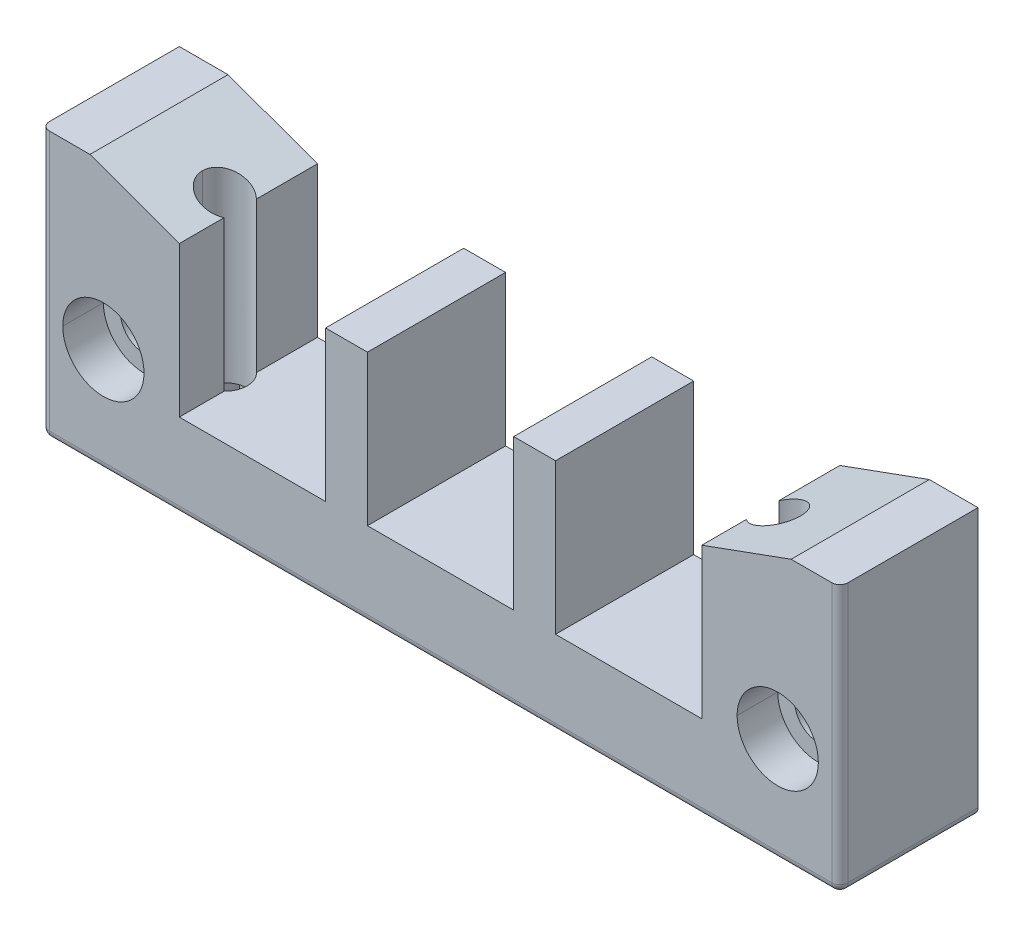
ISO-10303-21;
HEADER;
FILE_DESCRIPTION(('STEP AP214'),'2;1');
FILE_NAME('part.step','',(''),(''),'','','');
FILE_SCHEMA(('AUTOMOTIVE_DESIGN { 1 0 10303 214 1 1 1 1 }'));
ENDSEC;
DATA;
#1=APPLICATION_CONTEXT('core data for automotive mechanical design processes');
#2=APPLICATION_PROTOCOL_DEFINITION('international standard','automotive_design',2000,#1);
#3=PRODUCT_CONTEXT('',#1,'mechanical');
#4=PRODUCT('Part','Part','',(#3));
#5=PRODUCT_RELATED_PRODUCT_CATEGORY('part','',(#4));
#6=PRODUCT_DEFINITION_FORMATION('','',#4);
#7=PRODUCT_DEFINITION_CONTEXT('part definition',#1,'design');
#8=PRODUCT_DEFINITION('design','',#6,#7);
#9=PRODUCT_DEFINITION_SHAPE('','',#8);
#10=(LENGTH_UNIT() NAMED_UNIT(*) SI_UNIT(.MILLI.,.METRE.));
#11=(NAMED_UNIT(*) PLANE_ANGLE_UNIT() SI_UNIT($,.RADIAN.));
#12=(NAMED_UNIT(*) SI_UNIT($,.STERADIAN.) SOLID_ANGLE_UNIT());
#13=UNCERTAINTY_MEASURE_WITH_UNIT(LENGTH_MEASURE(1.E-05),#10,'distance_accuracy_value','');
#14=(GEOMETRIC_REPRESENTATION_CONTEXT(3) GLOBAL_UNCERTAINTY_ASSIGNED_CONTEXT((#13)) GLOBAL_UNIT_ASSIGNED_CONTEXT((#10,
#11,#12)) REPRESENTATION_CONTEXT('',''));
#15=CARTESIAN_POINT('',(0.,0.,0.));
#16=DIRECTION('',(0.,0.,1.));
#17=DIRECTION('',(1.,0.,0.));
#18=AXIS2_PLACEMENT_3D('',#15,#16,#17);
#19=CARTESIAN_POINT('',(38.9574772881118,7.5,9.5));
#20=DIRECTION('',(0.866025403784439,0.,0.5));
#21=DIRECTION('',(0.,-1.,0.));
#22=AXIS2_PLACEMENT_3D('',#19,#20,#21);
#23=PLANE('',#22);
#24=DIRECTION('',(-0.5,0.,0.866025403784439));
#25=VECTOR('',#24,1.);
#26=CARTESIAN_POINT('',(38.9574772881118,0.,9.5));
#27=LINE('',#26,#25);
#28=CARTESIAN_POINT('',(38.9574772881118,0.,9.5));
#29=VERTEX_POINT('',#28);
#30=CARTESIAN_POINT('',(36.5037386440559,0.,13.75));
#31=VERTEX_POINT('',#30);
#32=EDGE_CURVE('E485',#29,#31,#27,.T.);
#33=ORIENTED_EDGE('',*,*,#32,.T.);
#34=DIRECTION('',(0.,-1.,0.));
#35=VECTOR('',#34,1.);
#36=CARTESIAN_POINT('',(36.5037386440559,7.5,13.75));
#37=LINE('',#36,#35);
#38=CARTESIAN_POINT('',(36.5037386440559,7.5,13.75));
#39=VERTEX_POINT('',#38);
#40=EDGE_CURVE('E10',#39,#31,#37,.T.);
#41=ORIENTED_EDGE('',*,*,#40,.F.);
#42=DIRECTION('',(-0.5,0.,0.866025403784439));
#43=VECTOR('',#42,1.);
#44=CARTESIAN_POINT('',(38.9574772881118,7.5,9.5));
#45=LINE('',#44,#43);
#46=CARTESIAN_POINT('',(38.9574772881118,7.5,9.5));
#47=VERTEX_POINT('',#46);
#48=EDGE_CURVE('E602',#47,#39,#45,.T.);
#49=ORIENTED_EDGE('',*,*,#48,.F.);
#50=DIRECTION('',(0.,-1.,0.));
#51=VECTOR('',#50,1.);
#52=CARTESIAN_POINT('',(38.9574772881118,7.5,9.5));
#53=LINE('',#52,#51);
#54=EDGE_CURVE('E622',#47,#29,#53,.T.);
#55=ORIENTED_EDGE('',*,*,#54,.T.);
#56=EDGE_LOOP('',(#33,#41,#49,#55));
#57=FACE_BOUND('',#56,.T.);
#58=ADVANCED_FACE('F15',(#57),#23,.F.);
#59=CARTESIAN_POINT('',(36.5037386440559,7.5,13.75));
#60=DIRECTION('',(0.,0.,1.));
#61=DIRECTION('',(1.,0.,0.));
#62=AXIS2_PLACEMENT_3D('',#59,#60,#61);
#63=PLANE('',#62);
#64=DIRECTION('',(-1.,0.,0.));
#65=VECTOR('',#64,1.);
#66=CARTESIAN_POINT('',(36.5037386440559,0.,13.75));
#67=LINE('',#66,#65);
#68=CARTESIAN_POINT('',(31.5962613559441,0.,13.75));
#69=VERTEX_POINT('',#68);
#70=EDGE_CURVE('E499',#31,#69,#67,.T.);
#71=ORIENTED_EDGE('',*,*,#70,.T.);
#72=DIRECTION('',(0.,-1.,0.));
#73=VECTOR('',#72,1.);
#74=CARTESIAN_POINT('',(31.5962613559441,7.5,13.75));
#75=LINE('',#74,#73);
#76=CARTESIAN_POINT('',(31.5962613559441,7.5,13.75));
#77=VERTEX_POINT('',#76);
#78=EDGE_CURVE('E23',#77,#69,#75,.T.);
#79=ORIENTED_EDGE('',*,*,#78,.F.);
#80=DIRECTION('',(-1.,0.,0.));
#81=VECTOR('',#80,1.);
#82=CARTESIAN_POINT('',(36.5037386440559,7.5,13.75));
#83=LINE('',#82,#81);
#84=EDGE_CURVE('E606',#39,#77,#83,.T.);
#85=ORIENTED_EDGE('',*,*,#84,.F.);
#86=ORIENTED_EDGE('',*,*,#40,.T.);
#87=EDGE_LOOP('',(#71,#79,#85,#86));
#88=FACE_BOUND('',#87,.T.);
#89=ADVANCED_FACE('F638',(#88),#63,.F.);
#90=CARTESIAN_POINT('',(31.5962613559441,7.5,13.75));
#91=DIRECTION('',(-0.866025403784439,0.,0.5));
#92=DIRECTION('',(0.,1.,0.));
#93=AXIS2_PLACEMENT_3D('',#90,#91,#92);
#94=PLANE('',#93);
#95=DIRECTION('',(-0.5,0.,-0.866025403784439));
#96=VECTOR('',#95,1.);
#97=CARTESIAN_POINT('',(31.5962613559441,0.,13.75));
#98=LINE('',#97,#96);
#99=CARTESIAN_POINT('',(29.1425227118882,0.,9.5));
#100=VERTEX_POINT('',#99);
#101=EDGE_CURVE('E496',#69,#100,#98,.T.);
#102=ORIENTED_EDGE('',*,*,#101,.T.);
#103=DIRECTION('',(0.,-1.,0.));
#104=VECTOR('',#103,1.);
#105=CARTESIAN_POINT('',(29.1425227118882,7.5,9.5));
#106=LINE('',#105,#104);
#107=CARTESIAN_POINT('',(29.1425227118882,7.5,9.5));
#108=VERTEX_POINT('',#107);
#109=EDGE_CURVE('E42',#108,#100,#106,.T.);
#110=ORIENTED_EDGE('',*,*,#109,.F.);
#111=DIRECTION('',(-0.5,0.,-0.866025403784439));
#112=VECTOR('',#111,1.);
#113=CARTESIAN_POINT('',(31.5962613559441,7.5,13.75));
#114=LINE('',#113,#112);
#115=EDGE_CURVE('E610',#77,#108,#114,.T.);
#116=ORIENTED_EDGE('',*,*,#115,.F.);
#117=ORIENTED_EDGE('',*,*,#78,.T.);
#118=EDGE_LOOP('',(#102,#110,#116,#117));
#119=FACE_BOUND('',#118,.T.);
#120=ADVANCED_FACE('F632',(#119),#94,.F.);
#121=CARTESIAN_POINT('',(29.1425227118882,7.5,9.5));
#122=DIRECTION('',(-0.866025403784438,0.,-0.5));
#123=DIRECTION('',(-0.5,0.,0.866025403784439));
#124=AXIS2_PLACEMENT_3D('',#121,#122,#123);
#125=PLANE('',#124);
#126=DIRECTION('',(0.5,0.,-0.866025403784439));
#127=VECTOR('',#126,1.);
#128=CARTESIAN_POINT('',(29.1425227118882,0.,9.5));
#129=LINE('',#128,#127);
#130=CARTESIAN_POINT('',(31.5962613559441,0.,5.25));
#131=VERTEX_POINT('',#130);
#132=EDGE_CURVE('E500',#100,#131,#129,.T.);
#133=ORIENTED_EDGE('',*,*,#132,.T.);
#134=DIRECTION('',(0.,-1.,0.));
#135=VECTOR('',#134,1.);
#136=CARTESIAN_POINT('',(31.5962613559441,7.5,5.25));
#137=LINE('',#136,#135);
#138=CARTESIAN_POINT('',(31.5962613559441,7.5,5.25));
#139=VERTEX_POINT('',#138);
#140=EDGE_CURVE('E33',#139,#131,#137,.T.);
#141=ORIENTED_EDGE('',*,*,#140,.F.);
#142=DIRECTION('',(0.5,0.,-0.866025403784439));
#143=VECTOR('',#142,1.);
#144=CARTESIAN_POINT('',(29.1425227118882,7.5,9.5));
#145=LINE('',#144,#143);
#146=EDGE_CURVE('E614',#108,#139,#145,.T.);
#147=ORIENTED_EDGE('',*,*,#146,.F.);
#148=ORIENTED_EDGE('',*,*,#109,.T.);
#149=EDGE_LOOP('',(#133,#141,#147,#148));
#150=FACE_BOUND('',#149,.T.);
#151=ADVANCED_FACE('F1002',(#150),#125,.F.);
#152=CARTESIAN_POINT('',(31.5962613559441,7.5,5.25));
#153=DIRECTION('',(0.,0.,-1.));
#154=DIRECTION('',(0.,-1.,0.));
#155=AXIS2_PLACEMENT_3D('',#152,#153,#154);
#156=PLANE('',#155);
#157=DIRECTION('',(1.,0.,0.));
#158=VECTOR('',#157,1.);
#159=CARTESIAN_POINT('',(31.5962613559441,0.,5.25));
#160=LINE('',#159,#158);
#161=CARTESIAN_POINT('',(36.5037386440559,0.,5.25));
#162=VERTEX_POINT('',#161);
#163=EDGE_CURVE('E495',#131,#162,#160,.T.);
#164=ORIENTED_EDGE('',*,*,#163,.T.);
#165=DIRECTION('',(0.,-1.,0.));
#166=VECTOR('',#165,1.);
#167=CARTESIAN_POINT('',(36.5037386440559,7.5,5.25));
#168=LINE('',#167,#166);
#169=CARTESIAN_POINT('',(36.5037386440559,7.5,5.25));
#170=VERTEX_POINT('',#169);
#171=EDGE_CURVE('E625',#170,#162,#168,.T.);
#172=ORIENTED_EDGE('',*,*,#171,.F.);
#173=DIRECTION('',(1.,0.,0.));
#174=VECTOR('',#173,1.);
#175=CARTESIAN_POINT('',(31.5962613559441,7.5,5.25));
#176=LINE('',#175,#174);
#177=EDGE_CURVE('E618',#139,#170,#176,.T.);
#178=ORIENTED_EDGE('',*,*,#177,.F.);
#179=ORIENTED_EDGE('',*,*,#140,.T.);
#180=EDGE_LOOP('',(#164,#172,#178,#179));
#181=FACE_BOUND('',#180,.T.);
#182=ADVANCED_FACE('F999',(#181),#156,.F.);
#183=CARTESIAN_POINT('',(36.5037386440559,7.5,5.25));
#184=DIRECTION('',(0.866025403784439,0.,-0.5));
#185=DIRECTION('',(0.,-1.,0.));
#186=AXIS2_PLACEMENT_3D('',#183,#184,#185);
#187=PLANE('',#186);
#188=DIRECTION('',(0.5,0.,0.866025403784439));
#189=VECTOR('',#188,1.);
#190=CARTESIAN_POINT('',(36.5037386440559,0.,5.25));
#191=LINE('',#190,#189);
#192=EDGE_CURVE('E491',#162,#29,#191,.T.);
#193=ORIENTED_EDGE('',*,*,#192,.T.);
#194=ORIENTED_EDGE('',*,*,#54,.F.);
#195=DIRECTION('',(0.5,0.,0.866025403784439));
#196=VECTOR('',#195,1.);
#197=CARTESIAN_POINT('',(36.5037386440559,7.5,5.25));
#198=LINE('',#197,#196);
#199=EDGE_CURVE('E598',#170,#47,#198,.T.);
#200=ORIENTED_EDGE('',*,*,#199,.F.);
#201=ORIENTED_EDGE('',*,*,#171,.T.);
#202=EDGE_LOOP('',(#193,#194,#200,#201));
#203=FACE_BOUND('',#202,.T.);
#204=ADVANCED_FACE('F996',(#203),#187,.F.);
#205=CARTESIAN_POINT('',(0.,7.5,0.));
#206=DIRECTION('',(0.,-1.,0.));
#207=DIRECTION('',(0.,0.,-1.));
#208=AXIS2_PLACEMENT_3D('',#205,#206,#207);
#209=PLANE('',#208);
#210=CARTESIAN_POINT('',(34.05,7.5,9.5));
#211=DIRECTION('',(0.,1.,0.));
#212=DIRECTION('',(1.,0.,0.));
#213=AXIS2_PLACEMENT_3D('',#210,#211,#212);
#214=CIRCLE('',#213,2.75);
#215=CARTESIAN_POINT('',(31.3,7.5,9.5));
#216=VERTEX_POINT('',#215);
#217=CARTESIAN_POINT('',(36.8,7.5,9.5));
#218=VERTEX_POINT('',#217);
#219=EDGE_CURVE('E832',#216,#218,#214,.T.);
#220=ORIENTED_EDGE('',*,*,#219,.T.);
#221=CARTESIAN_POINT('',(34.05,7.5,9.5));
#222=DIRECTION('',(0.,1.,0.));
#223=DIRECTION('',(1.,0.,0.));
#224=AXIS2_PLACEMENT_3D('',#221,#222,#223);
#225=CIRCLE('',#224,2.75);
#226=EDGE_CURVE('E926',#218,#216,#225,.T.);
#227=ORIENTED_EDGE('',*,*,#226,.T.);
#228=EDGE_LOOP('',(#220,#227));
#229=FACE_BOUND('',#228,.T.);
#230=ORIENTED_EDGE('',*,*,#199,.T.);
#231=ORIENTED_EDGE('',*,*,#48,.T.);
#232=ORIENTED_EDGE('',*,*,#84,.T.);
#233=ORIENTED_EDGE('',*,*,#115,.T.);
#234=ORIENTED_EDGE('',*,*,#146,.T.);
#235=ORIENTED_EDGE('',*,*,#177,.T.);
#236=EDGE_LOOP('',(#230,#231,#232,#233,#234,#235));
#237=FACE_BOUND('',#236,.T.);
#238=ADVANCED_FACE('F1001',(#229,#237),#209,.T.);
#239=CARTESIAN_POINT('',(-31.5962613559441,7.5,5.25));
#240=DIRECTION('',(0.866025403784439,0.,-0.5));
#241=DIRECTION('',(0.,-1.,0.));
#242=AXIS2_PLACEMENT_3D('',#239,#240,#241);
#243=PLANE('',#242);
#244=DIRECTION('',(0.5,0.,0.866025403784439));
#245=VECTOR('',#244,1.);
#246=CARTESIAN_POINT('',(-31.5962613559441,0.,5.25));
#247=LINE('',#246,#245);
#248=CARTESIAN_POINT('',(-31.5962613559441,0.,5.25));
#249=VERTEX_POINT('',#248);
#250=CARTESIAN_POINT('',(-29.1425227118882,0.,9.5));
#251=VERTEX_POINT('',#250);
#252=EDGE_CURVE('E504',#249,#251,#247,.T.);
#253=ORIENTED_EDGE('',*,*,#252,.T.);
#254=DIRECTION('',(0.,-1.,0.));
#255=VECTOR('',#254,1.);
#256=CARTESIAN_POINT('',(-29.1425227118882,7.5,9.5));
#257=LINE('',#256,#255);
#258=CARTESIAN_POINT('',(-29.1425227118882,7.5,9.5));
#259=VERTEX_POINT('',#258);
#260=EDGE_CURVE('E595',#259,#251,#257,.T.);
#261=ORIENTED_EDGE('',*,*,#260,.F.);
#262=DIRECTION('',(0.5,0.,0.866025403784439));
#263=VECTOR('',#262,1.);
#264=CARTESIAN_POINT('',(-31.5962613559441,7.5,5.25));
#265=LINE('',#264,#263);
#266=CARTESIAN_POINT('',(-31.5962613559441,7.5,5.25));
#267=VERTEX_POINT('',#266);
#268=EDGE_CURVE('E560',#267,#259,#265,.T.);
#269=ORIENTED_EDGE('',*,*,#268,.F.);
#270=DIRECTION('',(0.,-1.,0.));
#271=VECTOR('',#270,1.);
#272=CARTESIAN_POINT('',(-31.5962613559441,7.5,5.25));
#273=LINE('',#272,#271);
#274=EDGE_CURVE('E580',#267,#249,#273,.T.);
#275=ORIENTED_EDGE('',*,*,#274,.T.);
#276=EDGE_LOOP('',(#253,#261,#269,#275));
#277=FACE_BOUND('',#276,.T.);
#278=ADVANCED_FACE('F1487',(#277),#243,.F.);
#279=CARTESIAN_POINT('',(-29.1425227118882,7.5,9.5));
#280=DIRECTION('',(0.86602540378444,0.,0.5));
#281=DIRECTION('',(0.,-1.,0.));
#282=AXIS2_PLACEMENT_3D('',#279,#280,#281);
#283=PLANE('',#282);
#284=DIRECTION('',(-0.5,0.,0.86602540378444));
#285=VECTOR('',#284,1.);
#286=CARTESIAN_POINT('',(-29.1425227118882,0.,9.5));
#287=LINE('',#286,#285);
#288=CARTESIAN_POINT('',(-31.5962613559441,0.,13.75));
#289=VERTEX_POINT('',#288);
#290=EDGE_CURVE('E521',#251,#289,#287,.T.);
#291=ORIENTED_EDGE('',*,*,#290,.T.);
#292=DIRECTION('',(0.,-1.,0.));
#293=VECTOR('',#292,1.);
#294=CARTESIAN_POINT('',(-31.5962613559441,7.5,13.75));
#295=LINE('',#294,#293);
#296=CARTESIAN_POINT('',(-31.5962613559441,7.5,13.75));
#297=VERTEX_POINT('',#296);
#298=EDGE_CURVE('E592',#297,#289,#295,.T.);
#299=ORIENTED_EDGE('',*,*,#298,.F.);
#300=DIRECTION('',(-0.5,0.,0.86602540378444));
#301=VECTOR('',#300,1.);
#302=CARTESIAN_POINT('',(-29.1425227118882,7.5,9.5));
#303=LINE('',#302,#301);
#304=EDGE_CURVE('E564',#259,#297,#303,.T.);
#305=ORIENTED_EDGE('',*,*,#304,.F.);
#306=ORIENTED_EDGE('',*,*,#260,.T.);
#307=EDGE_LOOP('',(#291,#299,#305,#306));
#308=FACE_BOUND('',#307,.T.);
#309=ADVANCED_FACE('F1068',(#308),#283,.F.);
#310=CARTESIAN_POINT('',(-31.5962613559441,7.5,13.75));
#311=DIRECTION('',(0.,0.,1.));
#312=DIRECTION('',(1.,0.,0.));
#313=AXIS2_PLACEMENT_3D('',#310,#311,#312);
#314=PLANE('',#313);
#315=DIRECTION('',(-1.,0.,0.));
#316=VECTOR('',#315,1.);
#317=CARTESIAN_POINT('',(-31.5962613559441,0.,13.75));
#318=LINE('',#317,#316);
#319=CARTESIAN_POINT('',(-36.5037386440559,0.,13.75));
#320=VERTEX_POINT('',#319);
#321=EDGE_CURVE('E517',#289,#320,#318,.T.);
#322=ORIENTED_EDGE('',*,*,#321,.T.);
#323=DIRECTION('',(0.,-1.,0.));
#324=VECTOR('',#323,1.);
#325=CARTESIAN_POINT('',(-36.5037386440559,7.5,13.75));
#326=LINE('',#325,#324);
#327=CARTESIAN_POINT('',(-36.5037386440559,7.5,13.75));
#328=VERTEX_POINT('',#327);
#329=EDGE_CURVE('E589',#328,#320,#326,.T.);
#330=ORIENTED_EDGE('',*,*,#329,.F.);
#331=DIRECTION('',(-1.,0.,0.));
#332=VECTOR('',#331,1.);
#333=CARTESIAN_POINT('',(-31.5962613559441,7.5,13.75));
#334=LINE('',#333,#332);
#335=EDGE_CURVE('E568',#297,#328,#334,.T.);
#336=ORIENTED_EDGE('',*,*,#335,.F.);
#337=ORIENTED_EDGE('',*,*,#298,.T.);
#338=EDGE_LOOP('',(#322,#330,#336,#337));
#339=FACE_BOUND('',#338,.T.);
#340=ADVANCED_FACE('F1065',(#339),#314,.F.);
#341=CARTESIAN_POINT('',(-36.5037386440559,7.5,13.75));
#342=DIRECTION('',(-0.86602540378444,0.,0.5));
#343=DIRECTION('',(0.,1.,0.));
#344=AXIS2_PLACEMENT_3D('',#341,#342,#343);
#345=PLANE('',#344);
#346=DIRECTION('',(-0.5,0.,-0.86602540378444));
#347=VECTOR('',#346,1.);
#348=CARTESIAN_POINT('',(-36.5037386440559,0.,13.75));
#349=LINE('',#348,#347);
#350=CARTESIAN_POINT('',(-38.9574772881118,0.,9.5));
#351=VERTEX_POINT('',#350);
#352=EDGE_CURVE('E513',#320,#351,#349,.T.);
#353=ORIENTED_EDGE('',*,*,#352,.T.);
#354=DIRECTION('',(0.,-1.,0.));
#355=VECTOR('',#354,1.);
#356=CARTESIAN_POINT('',(-38.9574772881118,7.5,9.5));
#357=LINE('',#356,#355);
#358=CARTESIAN_POINT('',(-38.9574772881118,7.5,9.5));
#359=VERTEX_POINT('',#358);
#360=EDGE_CURVE('E586',#359,#351,#357,.T.);
#361=ORIENTED_EDGE('',*,*,#360,.F.);
#362=DIRECTION('',(-0.5,0.,-0.86602540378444));
#363=VECTOR('',#362,1.);
#364=CARTESIAN_POINT('',(-36.5037386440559,7.5,13.75));
#365=LINE('',#364,#363);
#366=EDGE_CURVE('E572',#328,#359,#365,.T.);
#367=ORIENTED_EDGE('',*,*,#366,.F.);
#368=ORIENTED_EDGE('',*,*,#329,.T.);
#369=EDGE_LOOP('',(#353,#361,#367,#368));
#370=FACE_BOUND('',#369,.T.);
#371=ADVANCED_FACE('F1058',(#370),#345,.F.);
#372=CARTESIAN_POINT('',(-38.9574772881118,7.5,9.5));
#373=DIRECTION('',(-0.86602540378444,0.,-0.5));
#374=DIRECTION('',(-0.5,0.,0.86602540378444));
#375=AXIS2_PLACEMENT_3D('',#372,#373,#374);
#376=PLANE('',#375);
#377=DIRECTION('',(0.5,0.,-0.86602540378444));
#378=VECTOR('',#377,1.);
#379=CARTESIAN_POINT('',(-38.9574772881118,0.,9.5));
#380=LINE('',#379,#378);
#381=CARTESIAN_POINT('',(-36.5037386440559,0.,5.25));
#382=VERTEX_POINT('',#381);
#383=EDGE_CURVE('E509',#351,#382,#380,.T.);
#384=ORIENTED_EDGE('',*,*,#383,.T.);
#385=DIRECTION('',(0.,-1.,0.));
#386=VECTOR('',#385,1.);
#387=CARTESIAN_POINT('',(-36.5037386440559,7.5,5.25));
#388=LINE('',#387,#386);
#389=CARTESIAN_POINT('',(-36.5037386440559,7.5,5.25));
#390=VERTEX_POINT('',#389);
#391=EDGE_CURVE('E583',#390,#382,#388,.T.);
#392=ORIENTED_EDGE('',*,*,#391,.F.);
#393=DIRECTION('',(0.5,0.,-0.86602540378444));
#394=VECTOR('',#393,1.);
#395=CARTESIAN_POINT('',(-38.9574772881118,7.5,9.5));
#396=LINE('',#395,#394);
#397=EDGE_CURVE('E576',#359,#390,#396,.T.);
#398=ORIENTED_EDGE('',*,*,#397,.F.);
#399=ORIENTED_EDGE('',*,*,#360,.T.);
#400=EDGE_LOOP('',(#384,#392,#398,#399));
#401=FACE_BOUND('',#400,.T.);
#402=ADVANCED_FACE('F1054',(#401),#376,.F.);
#403=CARTESIAN_POINT('',(-36.5037386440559,7.5,5.25));
#404=DIRECTION('',(0.,0.,-1.));
#405=DIRECTION('',(0.,-1.,0.));
#406=AXIS2_PLACEMENT_3D('',#403,#404,#405);
#407=PLANE('',#406);
#408=DIRECTION('',(1.,0.,0.));
#409=VECTOR('',#408,1.);
#410=CARTESIAN_POINT('',(-36.5037386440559,0.,5.25));
#411=LINE('',#410,#409);
#412=EDGE_CURVE('E508',#382,#249,#411,.T.);
#413=ORIENTED_EDGE('',*,*,#412,.T.);
#414=ORIENTED_EDGE('',*,*,#274,.F.);
#415=DIRECTION('',(1.,0.,0.));
#416=VECTOR('',#415,1.);
#417=CARTESIAN_POINT('',(-36.5037386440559,7.5,5.25));
#418=LINE('',#417,#416);
#419=EDGE_CURVE('E556',#390,#267,#418,.T.);
#420=ORIENTED_EDGE('',*,*,#419,.F.);
#421=ORIENTED_EDGE('',*,*,#391,.T.);
#422=EDGE_LOOP('',(#413,#414,#420,#421));
#423=FACE_BOUND('',#422,.T.);
#424=ADVANCED_FACE('F1057',(#423),#407,.F.);
#425=CARTESIAN_POINT('',(0.,7.5,0.));
#426=DIRECTION('',(0.,-1.,0.));
#427=DIRECTION('',(0.,0.,-1.));
#428=AXIS2_PLACEMENT_3D('',#425,#426,#427);
#429=PLANE('',#428);
#430=CARTESIAN_POINT('',(-34.05,7.5,9.5));
#431=DIRECTION('',(0.,1.,0.));
#432=DIRECTION('',(1.,0.,0.));
#433=AXIS2_PLACEMENT_3D('',#430,#431,#432);
#434=CIRCLE('',#433,2.75);
#435=CARTESIAN_POINT('',(-36.8,7.5,9.5));
#436=VERTEX_POINT('',#435);
#437=CARTESIAN_POINT('',(-31.3,7.5,9.5));
#438=VERTEX_POINT('',#437);
#439=EDGE_CURVE('E851',#436,#438,#434,.T.);
#440=ORIENTED_EDGE('',*,*,#439,.T.);
#441=CARTESIAN_POINT('',(-34.05,7.5,9.5));
#442=DIRECTION('',(0.,1.,0.));
#443=DIRECTION('',(1.,0.,0.));
#444=AXIS2_PLACEMENT_3D('',#441,#442,#443);
#445=CIRCLE('',#444,2.75);
#446=EDGE_CURVE('E1623',#438,#436,#445,.T.);
#447=ORIENTED_EDGE('',*,*,#446,.T.);
#448=EDGE_LOOP('',(#440,#447));
#449=FACE_BOUND('',#448,.T.);
#450=ORIENTED_EDGE('',*,*,#419,.T.);
#451=ORIENTED_EDGE('',*,*,#268,.T.);
#452=ORIENTED_EDGE('',*,*,#304,.T.);
#453=ORIENTED_EDGE('',*,*,#335,.T.);
#454=ORIENTED_EDGE('',*,*,#366,.T.);
#455=ORIENTED_EDGE('',*,*,#397,.T.);
#456=EDGE_LOOP('',(#450,#451,#452,#453,#454,#455));
#457=FACE_BOUND('',#456,.T.);
#458=ADVANCED_FACE('F1441',(#449,#457),#429,.T.);
#459=CARTESIAN_POINT('',(41.5,13.,12.));
#460=DIRECTION('',(0.,0.,1.));
#461=DIRECTION('',(1.,0.,0.));
#462=AXIS2_PLACEMENT_3D('',#459,#460,#461);
#463=PLANE('',#462);
#464=CARTESIAN_POINT('',(41.5,13.,12.));
#465=DIRECTION('',(0.,0.,1.));
#466=DIRECTION('',(1.,0.,0.));
#467=AXIS2_PLACEMENT_3D('',#464,#465,#466);
#468=CIRCLE('',#467,2.9);
#469=CARTESIAN_POINT('',(38.6,13.,12.));
#470=VERTEX_POINT('',#469);
#471=CARTESIAN_POINT('',(44.4,13.,12.));
#472=VERTEX_POINT('',#471);
#473=EDGE_CURVE('E1613',#470,#472,#468,.T.);
#474=ORIENTED_EDGE('',*,*,#473,.F.);
#475=CARTESIAN_POINT('',(41.5,13.,12.));
#476=DIRECTION('',(0.,0.,1.));
#477=DIRECTION('',(1.,0.,0.));
#478=AXIS2_PLACEMENT_3D('',#475,#476,#477);
#479=CIRCLE('',#478,2.9);
#480=EDGE_CURVE('E660',#472,#470,#479,.T.);
#481=ORIENTED_EDGE('',*,*,#480,.F.);
#482=EDGE_LOOP('',(#474,#481));
#483=FACE_BOUND('',#482,.T.);
#484=CARTESIAN_POINT('',(41.5,13.,12.));
#485=DIRECTION('',(0.,0.,1.));
#486=DIRECTION('',(1.,0.,0.));
#487=AXIS2_PLACEMENT_3D('',#484,#485,#486);
#488=CIRCLE('',#487,5.);
#489=CARTESIAN_POINT('',(46.5,13.,12.));
#490=VERTEX_POINT('',#489);
#491=CARTESIAN_POINT('',(36.5,13.,12.));
#492=VERTEX_POINT('',#491);
#493=EDGE_CURVE('E553',#490,#492,#488,.T.);
#494=ORIENTED_EDGE('',*,*,#493,.T.);
#495=CARTESIAN_POINT('',(41.5,13.,12.));
#496=DIRECTION('',(0.,0.,1.));
#497=DIRECTION('',(1.,0.,0.));
#498=AXIS2_PLACEMENT_3D('',#495,#496,#497);
#499=CIRCLE('',#498,5.);
#500=EDGE_CURVE('E1700',#492,#490,#499,.T.);
#501=ORIENTED_EDGE('',*,*,#500,.T.);
#502=EDGE_LOOP('',(#494,#501));
#503=FACE_BOUND('',#502,.T.);
#504=ADVANCED_FACE('F1431',(#483,#503),#463,.T.);
#505=CARTESIAN_POINT('',(41.5,13.,12.));
#506=DIRECTION('',(0.,0.,1.));
#507=DIRECTION('',(1.,0.,0.));
#508=AXIS2_PLACEMENT_3D('',#505,#506,#507);
#509=CYLINDRICAL_SURFACE('',#508,5.);
#510=DIRECTION('',(0.,0.,1.));
#511=VECTOR('',#510,1.);
#512=CARTESIAN_POINT('',(36.5,13.,12.));
#513=LINE('',#512,#511);
#514=CARTESIAN_POINT('',(36.5,13.,17.));
#515=VERTEX_POINT('',#514);
#516=EDGE_CURVE('E1672',#492,#515,#513,.T.);
#517=ORIENTED_EDGE('',*,*,#516,.F.);
#518=ORIENTED_EDGE('',*,*,#493,.F.);
#519=DIRECTION('',(0.,0.,1.));
#520=VECTOR('',#519,1.);
#521=CARTESIAN_POINT('',(46.5,13.,12.));
#522=LINE('',#521,#520);
#523=CARTESIAN_POINT('',(46.5,13.,17.));
#524=VERTEX_POINT('',#523);
#525=EDGE_CURVE('E1671',#490,#524,#522,.T.);
#526=ORIENTED_EDGE('',*,*,#525,.T.);
#527=CARTESIAN_POINT('',(41.5,13.,17.));
#528=DIRECTION('',(0.,0.,1.));
#529=DIRECTION('',(1.,0.,0.));
#530=AXIS2_PLACEMENT_3D('',#527,#528,#529);
#531=CIRCLE('',#530,5.);
#532=EDGE_CURVE('E784',#524,#515,#531,.T.);
#533=ORIENTED_EDGE('',*,*,#532,.T.);
#534=EDGE_LOOP('',(#517,#518,#526,#533));
#535=FACE_BOUND('',#534,.T.);
#536=ADVANCED_FACE('F1422',(#535),#509,.F.);
#537=CARTESIAN_POINT('',(-41.5,13.,12.));
#538=DIRECTION('',(0.,0.,1.));
#539=DIRECTION('',(1.,0.,0.));
#540=AXIS2_PLACEMENT_3D('',#537,#538,#539);
#541=PLANE('',#540);
#542=CARTESIAN_POINT('',(-41.5,13.,12.));
#543=DIRECTION('',(0.,0.,1.));
#544=DIRECTION('',(1.,0.,0.));
#545=AXIS2_PLACEMENT_3D('',#542,#543,#544);
#546=CIRCLE('',#545,2.9);
#547=CARTESIAN_POINT('',(-44.4,13.,12.));
#548=VERTEX_POINT('',#547);
#549=CARTESIAN_POINT('',(-38.6,13.,12.));
#550=VERTEX_POINT('',#549);
#551=EDGE_CURVE('E1604',#548,#550,#546,.T.);
#552=ORIENTED_EDGE('',*,*,#551,.F.);
#553=CARTESIAN_POINT('',(-41.5,13.,12.));
#554=DIRECTION('',(0.,0.,1.));
#555=DIRECTION('',(1.,0.,0.));
#556=AXIS2_PLACEMENT_3D('',#553,#554,#555);
#557=CIRCLE('',#556,2.9);
#558=EDGE_CURVE('E672',#550,#548,#557,.T.);
#559=ORIENTED_EDGE('',*,*,#558,.F.);
#560=EDGE_LOOP('',(#552,#559));
#561=FACE_BOUND('',#560,.T.);
#562=CARTESIAN_POINT('',(-41.5,13.,12.));
#563=DIRECTION('',(0.,0.,1.));
#564=DIRECTION('',(1.,0.,0.));
#565=AXIS2_PLACEMENT_3D('',#562,#563,#564);
#566=CIRCLE('',#565,5.);
#567=CARTESIAN_POINT('',(-36.5,13.,12.));
#568=VERTEX_POINT('',#567);
#569=CARTESIAN_POINT('',(-46.5,13.,12.));
#570=VERTEX_POINT('',#569);
#571=EDGE_CURVE('E550',#568,#570,#566,.T.);
#572=ORIENTED_EDGE('',*,*,#571,.T.);
#573=CARTESIAN_POINT('',(-41.5,13.,12.));
#574=DIRECTION('',(0.,0.,1.));
#575=DIRECTION('',(1.,0.,0.));
#576=AXIS2_PLACEMENT_3D('',#573,#574,#575);
#577=CIRCLE('',#576,5.);
#578=EDGE_CURVE('E1684',#570,#568,#577,.T.);
#579=ORIENTED_EDGE('',*,*,#578,.T.);
#580=EDGE_LOOP('',(#572,#579));
#581=FACE_BOUND('',#580,.T.);
#582=ADVANCED_FACE('F1412',(#561,#581),#541,.T.);
#583=CARTESIAN_POINT('',(-41.5,13.,12.));
#584=DIRECTION('',(0.,0.,1.));
#585=DIRECTION('',(1.,0.,0.));
#586=AXIS2_PLACEMENT_3D('',#583,#584,#585);
#587=CYLINDRICAL_SURFACE('',#586,5.);
#588=DIRECTION('',(0.,0.,1.));
#589=VECTOR('',#588,1.);
#590=CARTESIAN_POINT('',(-46.5,13.,12.));
#591=LINE('',#590,#589);
#592=CARTESIAN_POINT('',(-46.5,13.,17.));
#593=VERTEX_POINT('',#592);
#594=EDGE_CURVE('E1595',#570,#593,#591,.T.);
#595=ORIENTED_EDGE('',*,*,#594,.F.);
#596=ORIENTED_EDGE('',*,*,#571,.F.);
#597=DIRECTION('',(0.,0.,1.));
#598=VECTOR('',#597,1.);
#599=CARTESIAN_POINT('',(-36.5,13.,12.));
#600=LINE('',#599,#598);
#601=CARTESIAN_POINT('',(-36.5,13.,17.));
#602=VERTEX_POINT('',#601);
#603=EDGE_CURVE('E1594',#568,#602,#600,.T.);
#604=ORIENTED_EDGE('',*,*,#603,.T.);
#605=CARTESIAN_POINT('',(-41.5,13.,17.));
#606=DIRECTION('',(0.,0.,1.));
#607=DIRECTION('',(1.,0.,0.));
#608=AXIS2_PLACEMENT_3D('',#605,#606,#607);
#609=CIRCLE('',#608,5.);
#610=EDGE_CURVE('E789',#602,#593,#609,.T.);
#611=ORIENTED_EDGE('',*,*,#610,.T.);
#612=EDGE_LOOP('',(#595,#596,#604,#611));
#613=FACE_BOUND('',#612,.T.);
#614=ADVANCED_FACE('F1402',(#613),#587,.F.);
#615=CARTESIAN_POINT('',(-9.,28.98,42.8118189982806));
#616=DIRECTION('',(1.,0.,0.));
#617=DIRECTION('',(0.,1.,0.));
#618=AXIS2_PLACEMENT_3D('',#615,#616,#617);
#619=PLANE('',#618);
#620=DIRECTION('',(0.,0.,-1.));
#621=VECTOR('',#620,1.);
#622=CARTESIAN_POINT('',(-9.,10.48,42.8118189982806));
#623=LINE('',#622,#621);
#624=CARTESIAN_POINT('',(-9.,10.48,17.));
#625=VERTEX_POINT('',#624);
#626=CARTESIAN_POINT('',(-9.,10.48,0.));
#627=VERTEX_POINT('',#626);
#628=EDGE_CURVE('E547',#625,#627,#623,.T.);
#629=ORIENTED_EDGE('',*,*,#628,.T.);
#630=DIRECTION('',(0.,-1.,0.));
#631=VECTOR('',#630,1.);
#632=CARTESIAN_POINT('',(-9.,28.98,0.));
#633=LINE('',#632,#631);
#634=CARTESIAN_POINT('',(-9.,28.98,0.));
#635=VERTEX_POINT('',#634);
#636=EDGE_CURVE('E729',#635,#627,#633,.T.);
#637=ORIENTED_EDGE('',*,*,#636,.F.);
#638=DIRECTION('',(0.,0.,-1.));
#639=VECTOR('',#638,1.);
#640=CARTESIAN_POINT('',(-9.,28.98,42.8118189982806));
#641=LINE('',#640,#639);
#642=CARTESIAN_POINT('',(-9.,28.98,17.));
#643=VERTEX_POINT('',#642);
#644=EDGE_CURVE('E792',#643,#635,#641,.T.);
#645=ORIENTED_EDGE('',*,*,#644,.F.);
#646=DIRECTION('',(0.,1.,0.));
#647=VECTOR('',#646,1.);
#648=CARTESIAN_POINT('',(-9.,28.98,17.));
#649=LINE('',#648,#647);
#650=EDGE_CURVE('E744',#625,#643,#649,.T.);
#651=ORIENTED_EDGE('',*,*,#650,.F.);
#652=EDGE_LOOP('',(#629,#637,#645,#651));
#653=FACE_BOUND('',#652,.T.);
#654=ADVANCED_FACE('F1393',(#653),#619,.T.);
#655=CARTESIAN_POINT('',(-9.,10.48,42.8118189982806));
#656=DIRECTION('',(0.,1.,0.));
#657=DIRECTION('',(1.,0.,0.));
#658=AXIS2_PLACEMENT_3D('',#655,#656,#657);
#659=PLANE('',#658);
#660=DIRECTION('',(0.,0.,-1.));
#661=VECTOR('',#660,1.);
#662=CARTESIAN_POINT('',(9.,10.48,42.8118189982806));
#663=LINE('',#662,#661);
#664=CARTESIAN_POINT('',(9.,10.48,17.));
#665=VERTEX_POINT('',#664);
#666=CARTESIAN_POINT('',(9.,10.48,0.));
#667=VERTEX_POINT('',#666);
#668=EDGE_CURVE('E489',#665,#667,#663,.T.);
#669=ORIENTED_EDGE('',*,*,#668,.T.);
#670=DIRECTION('',(1.,0.,0.));
#671=VECTOR('',#670,1.);
#672=CARTESIAN_POINT('',(-9.,10.48,0.));
#673=LINE('',#672,#671);
#674=EDGE_CURVE('E681',#627,#667,#673,.T.);
#675=ORIENTED_EDGE('',*,*,#674,.F.);
#676=ORIENTED_EDGE('',*,*,#628,.F.);
#677=DIRECTION('',(-1.,0.,0.));
#678=VECTOR('',#677,1.);
#679=CARTESIAN_POINT('',(-9.,10.48,17.));
#680=LINE('',#679,#678);
#681=EDGE_CURVE('E740',#665,#625,#680,.T.);
#682=ORIENTED_EDGE('',*,*,#681,.F.);
#683=EDGE_LOOP('',(#669,#675,#676,#682));
#684=FACE_BOUND('',#683,.T.);
#685=ADVANCED_FACE('F1383',(#684),#659,.T.);
#686=CARTESIAN_POINT('',(9.,28.98,42.8118189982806));
#687=DIRECTION('',(-1.,0.,0.));
#688=DIRECTION('',(0.,0.,1.));
#689=AXIS2_PLACEMENT_3D('',#686,#687,#688);
#690=PLANE('',#689);
#691=DIRECTION('',(0.,0.,-1.));
#692=VECTOR('',#691,1.);
#693=CARTESIAN_POINT('',(9.,28.98,42.8118189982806));
#694=LINE('',#693,#692);
#695=CARTESIAN_POINT('',(9.,28.98,17.));
#696=VERTEX_POINT('',#695);
#697=CARTESIAN_POINT('',(9.,28.98,0.));
#698=VERTEX_POINT('',#697);
#699=EDGE_CURVE('E793',#696,#698,#694,.T.);
#700=ORIENTED_EDGE('',*,*,#699,.T.);
#701=DIRECTION('',(0.,1.,0.));
#702=VECTOR('',#701,1.);
#703=CARTESIAN_POINT('',(9.,28.98,0.));
#704=LINE('',#703,#702);
#705=EDGE_CURVE('E682',#667,#698,#704,.T.);
#706=ORIENTED_EDGE('',*,*,#705,.F.);
#707=ORIENTED_EDGE('',*,*,#668,.F.);
#708=DIRECTION('',(0.,-1.,0.));
#709=VECTOR('',#708,1.);
#710=CARTESIAN_POINT('',(9.,28.98,17.));
#711=LINE('',#710,#709);
#712=EDGE_CURVE('E736',#696,#665,#711,.T.);
#713=ORIENTED_EDGE('',*,*,#712,.F.);
#714=EDGE_LOOP('',(#700,#706,#707,#713));
#715=FACE_BOUND('',#714,.T.);
#716=ADVANCED_FACE('F1373',(#715),#690,.T.);
#717=CARTESIAN_POINT('',(32.1535234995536,28.98,42.8118189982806));
#718=DIRECTION('',(-1.,0.,0.));
#719=DIRECTION('',(0.,0.,1.));
#720=AXIS2_PLACEMENT_3D('',#717,#718,#719);
#721=PLANE('',#720);
#722=DIRECTION('',(0.,-1.,0.));
#723=VECTOR('',#722,1.);
#724=CARTESIAN_POINT('',(32.1535234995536,-7.77817459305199,7.5085490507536));
#725=LINE('',#724,#723);
#726=CARTESIAN_POINT('',(32.1535234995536,28.98,7.5085490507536));
#727=VERTEX_POINT('',#726);
#728=CARTESIAN_POINT('',(32.1535234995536,10.48,7.5085490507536));
#729=VERTEX_POINT('',#728);
#730=EDGE_CURVE('E815',#727,#729,#725,.T.);
#731=ORIENTED_EDGE('',*,*,#730,.F.);
#732=DIRECTION('',(0.,0.,-1.));
#733=VECTOR('',#732,1.);
#734=CARTESIAN_POINT('',(32.1535234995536,28.98,115.382165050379));
#735=LINE('',#734,#733);
#736=CARTESIAN_POINT('',(32.1535234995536,28.98,0.));
#737=VERTEX_POINT('',#736);
#738=EDGE_CURVE('E542',#727,#737,#735,.T.);
#739=ORIENTED_EDGE('',*,*,#738,.T.);
#740=DIRECTION('',(0.,1.,0.));
#741=VECTOR('',#740,1.);
#742=CARTESIAN_POINT('',(32.1535234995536,28.98,0.));
#743=LINE('',#742,#741);
#744=CARTESIAN_POINT('',(32.1535234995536,10.48,0.));
#745=VERTEX_POINT('',#744);
#746=EDGE_CURVE('E704',#745,#737,#743,.T.);
#747=ORIENTED_EDGE('',*,*,#746,.F.);
#748=DIRECTION('',(0.,0.,-1.));
#749=VECTOR('',#748,1.);
#750=CARTESIAN_POINT('',(32.1535234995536,10.48,42.8118189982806));
#751=LINE('',#750,#749);
#752=EDGE_CURVE('E490',#729,#745,#751,.T.);
#753=ORIENTED_EDGE('',*,*,#752,.F.);
#754=EDGE_LOOP('',(#731,#739,#747,#753));
#755=FACE_BOUND('',#754,.T.);
#756=ADVANCED_FACE('F904',(#755),#721,.T.);
#757=CARTESIAN_POINT('',(14.1535234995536,28.98,42.8118189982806));
#758=DIRECTION('',(1.,0.,0.));
#759=DIRECTION('',(0.,1.,0.));
#760=AXIS2_PLACEMENT_3D('',#757,#758,#759);
#761=PLANE('',#760);
#762=DIRECTION('',(0.,0.,-1.));
#763=VECTOR('',#762,1.);
#764=CARTESIAN_POINT('',(14.1535234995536,10.48,42.8118189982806));
#765=LINE('',#764,#763);
#766=CARTESIAN_POINT('',(14.1535234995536,10.48,17.));
#767=VERTEX_POINT('',#766);
#768=CARTESIAN_POINT('',(14.1535234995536,10.48,0.));
#769=VERTEX_POINT('',#768);
#770=EDGE_CURVE('E486',#767,#769,#765,.T.);
#771=ORIENTED_EDGE('',*,*,#770,.T.);
#772=DIRECTION('',(0.,-1.,0.));
#773=VECTOR('',#772,1.);
#774=CARTESIAN_POINT('',(14.1535234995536,28.98,0.));
#775=LINE('',#774,#773);
#776=CARTESIAN_POINT('',(14.1535234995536,28.98,0.));
#777=VERTEX_POINT('',#776);
#778=EDGE_CURVE('E690',#777,#769,#775,.T.);
#779=ORIENTED_EDGE('',*,*,#778,.F.);
#780=DIRECTION('',(0.,0.,-1.));
#781=VECTOR('',#780,1.);
#782=CARTESIAN_POINT('',(14.1535234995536,28.98,42.8118189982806));
#783=LINE('',#782,#781);
#784=CARTESIAN_POINT('',(14.1535234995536,28.98,17.));
#785=VERTEX_POINT('',#784);
#786=EDGE_CURVE('E790',#785,#777,#783,.T.);
#787=ORIENTED_EDGE('',*,*,#786,.F.);
#788=DIRECTION('',(0.,1.,0.));
#789=VECTOR('',#788,1.);
#790=CARTESIAN_POINT('',(14.1535234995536,28.98,17.));
#791=LINE('',#790,#789);
#792=EDGE_CURVE('E774',#767,#785,#791,.T.);
#793=ORIENTED_EDGE('',*,*,#792,.F.);
#794=EDGE_LOOP('',(#771,#779,#787,#793));
#795=FACE_BOUND('',#794,.T.);
#796=ADVANCED_FACE('F912',(#795),#761,.T.);
#797=CARTESIAN_POINT('',(32.1535234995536,10.48,42.8118189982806));
#798=DIRECTION('',(0.,1.,0.));
#799=DIRECTION('',(1.,0.,0.));
#800=AXIS2_PLACEMENT_3D('',#797,#798,#799);
#801=PLANE('',#800);
#802=CARTESIAN_POINT('',(34.05,10.48,9.5));
#803=DIRECTION('',(0.,1.,0.));
#804=DIRECTION('',(-1.,0.,0.));
#805=AXIS2_PLACEMENT_3D('',#802,#803,#804);
#806=CIRCLE('',#805,2.75);
#807=CARTESIAN_POINT('',(31.3,10.48,9.5));
#808=VERTEX_POINT('',#807);
#809=EDGE_CURVE('E819',#729,#808,#806,.T.);
#810=ORIENTED_EDGE('',*,*,#809,.F.);
#811=ORIENTED_EDGE('',*,*,#752,.T.);
#812=DIRECTION('',(1.,0.,0.));
#813=VECTOR('',#812,1.);
#814=CARTESIAN_POINT('',(32.1535234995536,10.48,0.));
#815=LINE('',#814,#813);
#816=EDGE_CURVE('E700',#769,#745,#815,.T.);
#817=ORIENTED_EDGE('',*,*,#816,.F.);
#818=ORIENTED_EDGE('',*,*,#770,.F.);
#819=DIRECTION('',(-1.,0.,0.));
#820=VECTOR('',#819,1.);
#821=CARTESIAN_POINT('',(32.1535234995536,10.48,17.));
#822=LINE('',#821,#820);
#823=CARTESIAN_POINT('',(32.1535234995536,10.48,17.));
#824=VERTEX_POINT('',#823);
#825=EDGE_CURVE('E770',#824,#767,#822,.T.);
#826=ORIENTED_EDGE('',*,*,#825,.F.);
#827=DIRECTION('',(0.,0.,-1.));
#828=VECTOR('',#827,1.);
#829=CARTESIAN_POINT('',(32.1535234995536,10.48,42.8118189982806));
#830=LINE('',#829,#828);
#831=CARTESIAN_POINT('',(32.1535234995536,10.48,11.4914509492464));
#832=VERTEX_POINT('',#831);
#833=EDGE_CURVE('E653',#824,#832,#830,.T.);
#834=ORIENTED_EDGE('',*,*,#833,.T.);
#835=CARTESIAN_POINT('',(34.05,10.48,9.5));
#836=DIRECTION('',(0.,1.,0.));
#837=DIRECTION('',(-1.,0.,0.));
#838=AXIS2_PLACEMENT_3D('',#835,#836,#837);
#839=CIRCLE('',#838,2.75);
#840=EDGE_CURVE('E834',#808,#832,#839,.T.);
#841=ORIENTED_EDGE('',*,*,#840,.F.);
#842=EDGE_LOOP('',(#810,#811,#817,#818,#826,#834,#841));
#843=FACE_BOUND('',#842,.T.);
#844=ADVANCED_FACE('F885',(#843),#801,.T.);
#845=CARTESIAN_POINT('',(-32.1535234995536,28.98,42.8118189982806));
#846=DIRECTION('',(1.,0.,0.));
#847=DIRECTION('',(0.,1.,0.));
#848=AXIS2_PLACEMENT_3D('',#845,#846,#847);
#849=PLANE('',#848);
#850=DIRECTION('',(0.,-1.,0.));
#851=VECTOR('',#850,1.);
#852=CARTESIAN_POINT('',(-32.1535234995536,-7.77817459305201,11.4914509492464));
#853=LINE('',#852,#851);
#854=CARTESIAN_POINT('',(-32.1535234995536,28.98,11.4914509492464));
#855=VERTEX_POINT('',#854);
#856=CARTESIAN_POINT('',(-32.1535234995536,10.48,11.4914509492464));
#857=VERTEX_POINT('',#856);
#858=EDGE_CURVE('E860',#855,#857,#853,.T.);
#859=ORIENTED_EDGE('',*,*,#858,.F.);
#860=DIRECTION('',(0.,0.,-1.));
#861=VECTOR('',#860,1.);
#862=CARTESIAN_POINT('',(-32.1535234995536,28.98,115.382165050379));
#863=LINE('',#862,#861);
#864=CARTESIAN_POINT('',(-32.1535234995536,28.98,17.));
#865=VERTEX_POINT('',#864);
#866=EDGE_CURVE('E480',#865,#855,#863,.T.);
#867=ORIENTED_EDGE('',*,*,#866,.F.);
#868=DIRECTION('',(0.,1.,0.));
#869=VECTOR('',#868,1.);
#870=CARTESIAN_POINT('',(-32.1535234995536,28.98,17.));
#871=LINE('',#870,#869);
#872=CARTESIAN_POINT('',(-32.1535234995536,10.48,17.));
#873=VERTEX_POINT('',#872);
#874=EDGE_CURVE('E753',#873,#865,#871,.T.);
#875=ORIENTED_EDGE('',*,*,#874,.F.);
#876=DIRECTION('',(0.,0.,-1.));
#877=VECTOR('',#876,1.);
#878=CARTESIAN_POINT('',(-32.1535234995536,10.48,42.8118189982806));
#879=LINE('',#878,#877);
#880=EDGE_CURVE('E541',#873,#857,#879,.T.);
#881=ORIENTED_EDGE('',*,*,#880,.T.);
#882=EDGE_LOOP('',(#859,#867,#875,#881));
#883=FACE_BOUND('',#882,.T.);
#884=ADVANCED_FACE('F1338',(#883),#849,.T.);
#885=CARTESIAN_POINT('',(-32.1535234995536,10.48,42.8118189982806));
#886=DIRECTION('',(0.,1.,0.));
#887=DIRECTION('',(1.,0.,0.));
#888=AXIS2_PLACEMENT_3D('',#885,#886,#887);
#889=PLANE('',#888);
#890=CARTESIAN_POINT('',(-34.05,10.48,9.5));
#891=DIRECTION('',(0.,1.,0.));
#892=DIRECTION('',(0.,0.,1.));
#893=AXIS2_PLACEMENT_3D('',#890,#891,#892);
#894=CIRCLE('',#893,2.75);
#895=CARTESIAN_POINT('',(-31.3,10.48,9.5));
#896=VERTEX_POINT('',#895);
#897=EDGE_CURVE('E864',#857,#896,#894,.T.);
#898=ORIENTED_EDGE('',*,*,#897,.F.);
#899=ORIENTED_EDGE('',*,*,#880,.F.);
#900=DIRECTION('',(-1.,0.,0.));
#901=VECTOR('',#900,1.);
#902=CARTESIAN_POINT('',(-32.1535234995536,10.48,17.));
#903=LINE('',#902,#901);
#904=CARTESIAN_POINT('',(-14.1535234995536,10.48,17.));
#905=VERTEX_POINT('',#904);
#906=EDGE_CURVE('E749',#905,#873,#903,.T.);
#907=ORIENTED_EDGE('',*,*,#906,.F.);
#908=DIRECTION('',(0.,0.,-1.));
#909=VECTOR('',#908,1.);
#910=CARTESIAN_POINT('',(-14.1535234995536,10.48,42.8118189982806));
#911=LINE('',#910,#909);
#912=CARTESIAN_POINT('',(-14.1535234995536,10.48,0.));
#913=VERTEX_POINT('',#912);
#914=EDGE_CURVE('E538',#905,#913,#911,.T.);
#915=ORIENTED_EDGE('',*,*,#914,.T.);
#916=DIRECTION('',(1.,0.,0.));
#917=VECTOR('',#916,1.);
#918=CARTESIAN_POINT('',(-32.1535234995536,10.48,0.));
#919=LINE('',#918,#917);
#920=CARTESIAN_POINT('',(-32.1535234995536,10.48,0.));
#921=VERTEX_POINT('',#920);
#922=EDGE_CURVE('E838',#921,#913,#919,.T.);
#923=ORIENTED_EDGE('',*,*,#922,.F.);
#924=DIRECTION('',(0.,0.,-1.));
#925=VECTOR('',#924,1.);
#926=CARTESIAN_POINT('',(-32.1535234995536,10.48,42.8118189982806));
#927=LINE('',#926,#925);
#928=CARTESIAN_POINT('',(-32.1535234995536,10.48,7.50854905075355));
#929=VERTEX_POINT('',#928);
#930=EDGE_CURVE('E874',#929,#921,#927,.T.);
#931=ORIENTED_EDGE('',*,*,#930,.F.);
#932=CARTESIAN_POINT('',(-34.05,10.48,9.5));
#933=DIRECTION('',(0.,1.,0.));
#934=DIRECTION('',(0.,0.,1.));
#935=AXIS2_PLACEMENT_3D('',#932,#933,#934);
#936=CIRCLE('',#935,2.75);
#937=EDGE_CURVE('E1637',#896,#929,#936,.T.);
#938=ORIENTED_EDGE('',*,*,#937,.F.);
#939=EDGE_LOOP('',(#898,#899,#907,#915,#923,#931,#938));
#940=FACE_BOUND('',#939,.T.);
#941=ADVANCED_FACE('F1329',(#940),#889,.T.);
#942=CARTESIAN_POINT('',(-14.1535234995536,28.98,42.8118189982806));
#943=DIRECTION('',(-1.,0.,0.));
#944=DIRECTION('',(0.,1.,0.));
#945=AXIS2_PLACEMENT_3D('',#942,#943,#944);
#946=PLANE('',#945);
#947=DIRECTION('',(0.,0.,-1.));
#948=VECTOR('',#947,1.);
#949=CARTESIAN_POINT('',(-14.1535234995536,28.98,42.8118189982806));
#950=LINE('',#949,#948);
#951=CARTESIAN_POINT('',(-14.1535234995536,28.98,17.));
#952=VERTEX_POINT('',#951);
#953=CARTESIAN_POINT('',(-14.1535234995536,28.98,0.));
#954=VERTEX_POINT('',#953);
#955=EDGE_CURVE('E477',#952,#954,#950,.T.);
#956=ORIENTED_EDGE('',*,*,#955,.T.);
#957=DIRECTION('',(0.,1.,0.));
#958=VECTOR('',#957,1.);
#959=CARTESIAN_POINT('',(-14.1535234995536,28.98,0.));
#960=LINE('',#959,#958);
#961=EDGE_CURVE('E730',#913,#954,#960,.T.);
#962=ORIENTED_EDGE('',*,*,#961,.F.);
#963=ORIENTED_EDGE('',*,*,#914,.F.);
#964=DIRECTION('',(0.,-1.,0.));
#965=VECTOR('',#964,1.);
#966=CARTESIAN_POINT('',(-14.1535234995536,28.98,17.));
#967=LINE('',#966,#965);
#968=EDGE_CURVE('E754',#952,#905,#967,.T.);
#969=ORIENTED_EDGE('',*,*,#968,.F.);
#970=EDGE_LOOP('',(#956,#962,#963,#969));
#971=FACE_BOUND('',#970,.T.);
#972=ADVANCED_FACE('F1321',(#971),#946,.T.);
#973=CARTESIAN_POINT('',(43.1535234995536,32.98,115.382165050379));
#974=DIRECTION('',(-0.341743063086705,0.939793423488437,0.));
#975=DIRECTION('',(0.,0.,1.));
#976=AXIS2_PLACEMENT_3D('',#973,#974,#975);
#977=PLANE('',#976);
#978=CARTESIAN_POINT('',(32.1535234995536,28.98,11.4914509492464));
#979=CARTESIAN_POINT('',(34.2011153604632,29.7245788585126,13.4413909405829));
#980=CARTESIAN_POINT('',(36.7999999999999,30.6696278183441,12.3275251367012));
#981=CARTESIAN_POINT('',(36.8,30.6696278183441,9.5));
#982=(BOUNDED_CURVE() B_SPLINE_CURVE(3,(#978,#979,#980,#981),.UNSPECIFIED.,.F.,
.F.) B_SPLINE_CURVE_WITH_KNOTS((4,4),(3.95141400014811,6.28318530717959),
.UNSPECIFIED.) CURVE() GEOMETRIC_REPRESENTATION_ITEM() RATIONAL_B_SPLINE_CURVE((1.,
0.595957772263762,0.595957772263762,1.)) REPRESENTATION_ITEM(''));
#983=CARTESIAN_POINT('',(32.1535234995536,28.98,11.4914509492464));
#984=VERTEX_POINT('',#983);
#985=CARTESIAN_POINT('',(36.8,30.6696278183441,9.5));
#986=VERTEX_POINT('',#985);
#987=EDGE_CURVE('E846',#984,#986,#982,.T.);
#988=ORIENTED_EDGE('',*,*,#987,.F.);
#989=DIRECTION('',(0.,0.,-1.));
#990=VECTOR('',#989,1.);
#991=CARTESIAN_POINT('',(32.1535234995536,28.98,115.382165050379));
#992=LINE('',#991,#990);
#993=CARTESIAN_POINT('',(32.1535234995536,28.98,17.));
#994=VERTEX_POINT('',#993);
#995=EDGE_CURVE('E657',#994,#984,#992,.T.);
#996=ORIENTED_EDGE('',*,*,#995,.F.);
#997=DIRECTION('',(-0.939793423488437,-0.341743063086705,0.));
#998=VECTOR('',#997,1.);
#999=CARTESIAN_POINT('',(43.1535234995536,32.98,17.));
#1000=LINE('',#999,#998);
#1001=CARTESIAN_POINT('',(43.1535234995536,32.98,17.));
#1002=VERTEX_POINT('',#1001);
#1003=EDGE_CURVE('E767',#1002,#994,#1000,.T.);
#1004=ORIENTED_EDGE('',*,*,#1003,.F.);
#1005=DIRECTION('',(0.,0.,-1.));
#1006=VECTOR('',#1005,1.);
#1007=CARTESIAN_POINT('',(43.1535234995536,32.98,115.382165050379));
#1008=LINE('',#1007,#1006);
#1009=CARTESIAN_POINT('',(43.1535234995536,32.98,0.));
#1010=VERTEX_POINT('',#1009);
#1011=EDGE_CURVE('E1644',#1002,#1010,#1008,.T.);
#1012=ORIENTED_EDGE('',*,*,#1011,.T.);
#1013=DIRECTION('',(0.939793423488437,0.341743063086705,0.));
#1014=VECTOR('',#1013,1.);
#1015=CARTESIAN_POINT('',(43.1535234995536,32.98,0.));
#1016=LINE('',#1015,#1014);
#1017=EDGE_CURVE('E708',#737,#1010,#1016,.T.);
#1018=ORIENTED_EDGE('',*,*,#1017,.F.);
#1019=ORIENTED_EDGE('',*,*,#738,.F.);
#1020=CARTESIAN_POINT('',(36.8,30.6696278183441,9.5));
#1021=CARTESIAN_POINT('',(36.8,30.6696278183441,6.67247486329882));
#1022=CARTESIAN_POINT('',(34.2011153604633,29.7245788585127,5.55860905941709));
#1023=CARTESIAN_POINT('',(32.1535234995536,28.98,7.5085490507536));
#1024=(BOUNDED_CURVE() B_SPLINE_CURVE(3,(#1020,#1021,#1022,#1023),.UNSPECIFIED.,.F.,
.F.) B_SPLINE_CURVE_WITH_KNOTS((4,4),(0.,2.33177130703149),
.UNSPECIFIED.) CURVE() GEOMETRIC_REPRESENTATION_ITEM() RATIONAL_B_SPLINE_CURVE((1.,
0.595957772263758,0.595957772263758,1.)) REPRESENTATION_ITEM(''));
#1025=EDGE_CURVE('E808',#986,#727,#1024,.T.);
#1026=ORIENTED_EDGE('',*,*,#1025,.F.);
#1027=EDGE_LOOP('',(#988,#996,#1004,#1012,#1018,#1019,#1026));
#1028=FACE_BOUND('',#1027,.T.);
#1029=ADVANCED_FACE('F921',(#1028),#977,.T.);
#1030=CARTESIAN_POINT('',(49.15,32.98,115.382165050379));
#1031=DIRECTION('',(0.,1.,0.));
#1032=DIRECTION('',(1.,0.,0.));
#1033=AXIS2_PLACEMENT_3D('',#1030,#1031,#1032);
#1034=PLANE('',#1033);
#1035=DIRECTION('',(0.,0.,-1.));
#1036=VECTOR('',#1035,1.);
#1037=CARTESIAN_POINT('',(49.15,32.98,115.382165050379));
#1038=LINE('',#1037,#1036);
#1039=CARTESIAN_POINT('',(49.15,32.98,16.));
#1040=VERTEX_POINT('',#1039);
#1041=CARTESIAN_POINT('',(49.15,32.98,0.));
#1042=VERTEX_POINT('',#1041);
#1043=EDGE_CURVE('E940',#1040,#1042,#1038,.T.);
#1044=ORIENTED_EDGE('',*,*,#1043,.T.);
#1045=DIRECTION('',(1.,0.,0.));
#1046=VECTOR('',#1045,1.);
#1047=CARTESIAN_POINT('',(49.15,32.98,0.));
#1048=LINE('',#1047,#1046);
#1049=EDGE_CURVE('E712',#1010,#1042,#1048,.T.);
#1050=ORIENTED_EDGE('',*,*,#1049,.F.);
#1051=ORIENTED_EDGE('',*,*,#1011,.F.);
#1052=DIRECTION('',(-1.,0.,0.));
#1053=VECTOR('',#1052,1.);
#1054=CARTESIAN_POINT('',(49.15,32.98,17.));
#1055=LINE('',#1054,#1053);
#1056=CARTESIAN_POINT('',(48.15,32.98,17.));
#1057=VERTEX_POINT('',#1056);
#1058=EDGE_CURVE('E766',#1057,#1002,#1055,.T.);
#1059=ORIENTED_EDGE('',*,*,#1058,.F.);
#1060=CARTESIAN_POINT('',(48.15,32.98,16.));
#1061=DIRECTION('',(0.,-1.,0.));
#1062=DIRECTION('',(0.,0.,1.));
#1063=AXIS2_PLACEMENT_3D('',#1060,#1061,#1062);
#1064=CIRCLE('',#1063,1.);
#1065=EDGE_CURVE('E696',#1040,#1057,#1064,.T.);
#1066=ORIENTED_EDGE('',*,*,#1065,.F.);
#1067=EDGE_LOOP('',(#1044,#1050,#1051,#1059,#1066));
#1068=FACE_BOUND('',#1067,.T.);
#1069=ADVANCED_FACE('F977',(#1068),#1034,.T.);
#1070=CARTESIAN_POINT('',(-43.1535234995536,32.98,115.382165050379));
#1071=DIRECTION('',(0.341743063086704,0.939793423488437,0.));
#1072=DIRECTION('',(0.,0.,-1.));
#1073=AXIS2_PLACEMENT_3D('',#1070,#1071,#1072);
#1074=PLANE('',#1073);
#1075=CARTESIAN_POINT('',(-32.1535234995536,28.98,7.50854905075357));
#1076=CARTESIAN_POINT('',(-34.2011153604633,29.7245788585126,5.55860905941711));
#1077=CARTESIAN_POINT('',(-36.7999999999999,30.6696278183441,6.67247486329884));
#1078=CARTESIAN_POINT('',(-36.8,30.6696278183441,9.5));
#1079=(BOUNDED_CURVE() B_SPLINE_CURVE(3,(#1075,#1076,#1077,#1078),.UNSPECIFIED.,.F.,
.F.) B_SPLINE_CURVE_WITH_KNOTS((4,4),(3.95141400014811,6.28318530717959),
.UNSPECIFIED.) CURVE() GEOMETRIC_REPRESENTATION_ITEM() RATIONAL_B_SPLINE_CURVE((1.,
0.595957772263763,0.595957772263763,1.)) REPRESENTATION_ITEM(''));
#1080=CARTESIAN_POINT('',(-32.1535234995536,28.98,7.50854905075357));
#1081=VERTEX_POINT('',#1080);
#1082=CARTESIAN_POINT('',(-36.8,30.6696278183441,9.5));
#1083=VERTEX_POINT('',#1082);
#1084=EDGE_CURVE('E936',#1081,#1083,#1079,.T.);
#1085=ORIENTED_EDGE('',*,*,#1084,.F.);
#1086=DIRECTION('',(0.,0.,-1.));
#1087=VECTOR('',#1086,1.);
#1088=CARTESIAN_POINT('',(-32.1535234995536,28.98,115.382165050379));
#1089=LINE('',#1088,#1087);
#1090=CARTESIAN_POINT('',(-32.1535234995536,28.98,0.));
#1091=VERTEX_POINT('',#1090);
#1092=EDGE_CURVE('E873',#1081,#1091,#1089,.T.);
#1093=ORIENTED_EDGE('',*,*,#1092,.T.);
#1094=DIRECTION('',(0.939793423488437,-0.341743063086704,0.));
#1095=VECTOR('',#1094,1.);
#1096=CARTESIAN_POINT('',(-43.1535234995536,32.98,0.));
#1097=LINE('',#1096,#1095);
#1098=CARTESIAN_POINT('',(-43.1535234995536,32.98,0.));
#1099=VERTEX_POINT('',#1098);
#1100=EDGE_CURVE('E721',#1099,#1091,#1097,.T.);
#1101=ORIENTED_EDGE('',*,*,#1100,.F.);
#1102=DIRECTION('',(0.,0.,-1.));
#1103=VECTOR('',#1102,1.);
#1104=CARTESIAN_POINT('',(-43.1535234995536,32.98,115.382165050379));
#1105=LINE('',#1104,#1103);
#1106=CARTESIAN_POINT('',(-43.1535234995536,32.98,17.));
#1107=VERTEX_POINT('',#1106);
#1108=EDGE_CURVE('E865',#1107,#1099,#1105,.T.);
#1109=ORIENTED_EDGE('',*,*,#1108,.F.);
#1110=DIRECTION('',(-0.939793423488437,0.341743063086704,0.));
#1111=VECTOR('',#1110,1.);
#1112=CARTESIAN_POINT('',(-43.1535234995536,32.98,17.));
#1113=LINE('',#1112,#1111);
#1114=EDGE_CURVE('E666',#865,#1107,#1113,.T.);
#1115=ORIENTED_EDGE('',*,*,#1114,.F.);
#1116=ORIENTED_EDGE('',*,*,#866,.T.);
#1117=CARTESIAN_POINT('',(-36.8,30.6696278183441,9.5));
#1118=CARTESIAN_POINT('',(-36.8,30.6696278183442,12.3275251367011));
#1119=CARTESIAN_POINT('',(-34.2011153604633,29.7245788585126,13.4413909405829));
#1120=CARTESIAN_POINT('',(-32.1535234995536,28.98,11.4914509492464));
#1121=(BOUNDED_CURVE() B_SPLINE_CURVE(3,(#1117,#1118,#1119,#1120),.UNSPECIFIED.,.F.,
.F.) B_SPLINE_CURVE_WITH_KNOTS((4,4),(0.,2.33177130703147),
.UNSPECIFIED.) CURVE() GEOMETRIC_REPRESENTATION_ITEM() RATIONAL_B_SPLINE_CURVE((1.,
0.595957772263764,0.595957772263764,1.)) REPRESENTATION_ITEM(''));
#1122=EDGE_CURVE('E859',#1083,#855,#1121,.T.);
#1123=ORIENTED_EDGE('',*,*,#1122,.F.);
#1124=EDGE_LOOP('',(#1085,#1093,#1101,#1109,#1115,#1116,#1123));
#1125=FACE_BOUND('',#1124,.T.);
#1126=ADVANCED_FACE('F973',(#1125),#1074,.T.);
#1127=CARTESIAN_POINT('',(-49.15,32.98,115.382165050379));
#1128=DIRECTION('',(0.,1.,0.));
#1129=DIRECTION('',(1.,0.,0.));
#1130=AXIS2_PLACEMENT_3D('',#1127,#1128,#1129);
#1131=PLANE('',#1130);
#1132=DIRECTION('',(-1.,0.,0.));
#1133=VECTOR('',#1132,1.);
#1134=CARTESIAN_POINT('',(-49.15,32.98,17.));
#1135=LINE('',#1134,#1133);
#1136=CARTESIAN_POINT('',(-48.15,32.98,17.));
#1137=VERTEX_POINT('',#1136);
#1138=EDGE_CURVE('E661',#1107,#1137,#1135,.T.);
#1139=ORIENTED_EDGE('',*,*,#1138,.F.);
#1140=ORIENTED_EDGE('',*,*,#1108,.T.);
#1141=DIRECTION('',(1.,0.,0.));
#1142=VECTOR('',#1141,1.);
#1143=CARTESIAN_POINT('',(-49.15,32.98,0.));
#1144=LINE('',#1143,#1142);
#1145=CARTESIAN_POINT('',(-49.15,32.98,0.));
#1146=VERTEX_POINT('',#1145);
#1147=EDGE_CURVE('E717',#1146,#1099,#1144,.T.);
#1148=ORIENTED_EDGE('',*,*,#1147,.F.);
#1149=DIRECTION('',(0.,0.,-1.));
#1150=VECTOR('',#1149,1.);
#1151=CARTESIAN_POINT('',(-49.15,32.98,115.382165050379));
#1152=LINE('',#1151,#1150);
#1153=CARTESIAN_POINT('',(-49.15,32.98,16.));
#1154=VERTEX_POINT('',#1153);
#1155=EDGE_CURVE('E868',#1154,#1146,#1152,.T.);
#1156=ORIENTED_EDGE('',*,*,#1155,.F.);
#1157=CARTESIAN_POINT('',(-48.15,32.98,16.));
#1158=DIRECTION('',(0.,-1.,0.));
#1159=DIRECTION('',(0.,0.,1.));
#1160=AXIS2_PLACEMENT_3D('',#1157,#1158,#1159);
#1161=CIRCLE('',#1160,1.);
#1162=EDGE_CURVE('E691',#1137,#1154,#1161,.T.);
#1163=ORIENTED_EDGE('',*,*,#1162,.F.);
#1164=EDGE_LOOP('',(#1139,#1140,#1148,#1156,#1163));
#1165=FACE_BOUND('',#1164,.T.);
#1166=ADVANCED_FACE('F971',(#1165),#1131,.T.);
#1167=CARTESIAN_POINT('',(-49.15,0.,17.));
#1168=DIRECTION('',(1.,0.,0.));
#1169=DIRECTION('',(0.,1.,0.));
#1170=AXIS2_PLACEMENT_3D('',#1167,#1168,#1169);
#1171=PLANE('',#1170);
#1172=ORIENTED_EDGE('',*,*,#1155,.T.);
#1173=DIRECTION('',(0.,-1.,0.));
#1174=VECTOR('',#1173,1.);
#1175=CARTESIAN_POINT('',(-49.15,0.,0.));
#1176=LINE('',#1175,#1174);
#1177=CARTESIAN_POINT('',(-49.15,1.,0.));
#1178=VERTEX_POINT('',#1177);
#1179=EDGE_CURVE('E722',#1146,#1178,#1176,.T.);
#1180=ORIENTED_EDGE('',*,*,#1179,.T.);
#1181=DIRECTION('',(0.,0.,1.));
#1182=VECTOR('',#1181,1.);
#1183=CARTESIAN_POINT('',(-49.15,1.,17.));
#1184=LINE('',#1183,#1182);
#1185=CARTESIAN_POINT('',(-49.15,1.,16.));
#1186=VERTEX_POINT('',#1185);
#1187=EDGE_CURVE('E446',#1178,#1186,#1184,.T.);
#1188=ORIENTED_EDGE('',*,*,#1187,.T.);
#1189=DIRECTION('',(0.,1.,0.));
#1190=VECTOR('',#1189,1.);
#1191=CARTESIAN_POINT('',(-49.15,0.,16.));
#1192=LINE('',#1191,#1190);
#1193=EDGE_CURVE('E695',#1186,#1154,#1192,.T.);
#1194=ORIENTED_EDGE('',*,*,#1193,.T.);
#1195=EDGE_LOOP('',(#1172,#1180,#1188,#1194));
#1196=FACE_BOUND('',#1195,.T.);
#1197=ADVANCED_FACE('F967',(#1196),#1171,.F.);
#1198=CARTESIAN_POINT('',(49.15,0.,17.));
#1199=DIRECTION('',(-1.,0.,0.));
#1200=DIRECTION('',(0.,0.,1.));
#1201=AXIS2_PLACEMENT_3D('',#1198,#1199,#1200);
#1202=PLANE('',#1201);
#1203=ORIENTED_EDGE('',*,*,#1043,.F.);
#1204=DIRECTION('',(0.,-1.,0.));
#1205=VECTOR('',#1204,1.);
#1206=CARTESIAN_POINT('',(49.15,0.,16.));
#1207=LINE('',#1206,#1205);
#1208=CARTESIAN_POINT('',(49.15,1.00000000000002,16.));
#1209=VERTEX_POINT('',#1208);
#1210=EDGE_CURVE('E537',#1040,#1209,#1207,.T.);
#1211=ORIENTED_EDGE('',*,*,#1210,.T.);
#1212=DIRECTION('',(0.,0.,-1.));
#1213=VECTOR('',#1212,1.);
#1214=CARTESIAN_POINT('',(49.15,1.00000000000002,17.));
#1215=LINE('',#1214,#1213);
#1216=CARTESIAN_POINT('',(49.15,1.00000000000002,0.));
#1217=VERTEX_POINT('',#1216);
#1218=EDGE_CURVE('E525',#1209,#1217,#1215,.T.);
#1219=ORIENTED_EDGE('',*,*,#1218,.T.);
#1220=DIRECTION('',(0.,1.,0.));
#1221=VECTOR('',#1220,1.);
#1222=CARTESIAN_POINT('',(49.15,0.,0.));
#1223=LINE('',#1222,#1221);
#1224=EDGE_CURVE('E715',#1217,#1042,#1223,.T.);
#1225=ORIENTED_EDGE('',*,*,#1224,.T.);
#1226=EDGE_LOOP('',(#1203,#1211,#1219,#1225));
#1227=FACE_BOUND('',#1226,.T.);
#1228=ADVANCED_FACE('F1064',(#1227),#1202,.F.);
#1229=CARTESIAN_POINT('',(-48.15,0.,16.));
#1230=DIRECTION('',(0.,-1.,0.));
#1231=DIRECTION('',(1.,0.,0.));
#1232=AXIS2_PLACEMENT_3D('',#1229,#1230,#1231);
#1233=CYLINDRICAL_SURFACE('',#1232,1.);
#1234=DIRECTION('',(0.,-1.,0.));
#1235=VECTOR('',#1234,1.);
#1236=CARTESIAN_POINT('',(-48.15,0.,17.));
#1237=LINE('',#1236,#1235);
#1238=CARTESIAN_POINT('',(-48.15,1.,17.));
#1239=VERTEX_POINT('',#1238);
#1240=EDGE_CURVE('E665',#1137,#1239,#1237,.T.);
#1241=ORIENTED_EDGE('',*,*,#1240,.F.);
#1242=ORIENTED_EDGE('',*,*,#1162,.T.);
#1243=ORIENTED_EDGE('',*,*,#1193,.F.);
#1244=CARTESIAN_POINT('',(-48.15,1.,16.));
#1245=DIRECTION('',(0.,-1.,0.));
#1246=DIRECTION('',(1.,0.,0.));
#1247=AXIS2_PLACEMENT_3D('',#1244,#1245,#1246);
#1248=CIRCLE('',#1247,1.);
#1249=EDGE_CURVE('E455',#1239,#1186,#1248,.T.);
#1250=ORIENTED_EDGE('',*,*,#1249,.F.);
#1251=EDGE_LOOP('',(#1241,#1242,#1243,#1250));
#1252=FACE_BOUND('',#1251,.T.);
#1253=ADVANCED_FACE('F965',(#1252),#1233,.T.);
#1254=CARTESIAN_POINT('',(48.15,0.,16.));
#1255=DIRECTION('',(0.,1.,0.));
#1256=DIRECTION('',(0.,0.,1.));
#1257=AXIS2_PLACEMENT_3D('',#1254,#1255,#1256);
#1258=CYLINDRICAL_SURFACE('',#1257,1.);
#1259=ORIENTED_EDGE('',*,*,#1210,.F.);
#1260=ORIENTED_EDGE('',*,*,#1065,.T.);
#1261=DIRECTION('',(0.,1.,0.));
#1262=VECTOR('',#1261,1.);
#1263=CARTESIAN_POINT('',(48.15,0.,17.));
#1264=LINE('',#1263,#1262);
#1265=CARTESIAN_POINT('',(48.15,1.00000000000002,17.));
#1266=VERTEX_POINT('',#1265);
#1267=EDGE_CURVE('E675',#1266,#1057,#1264,.T.);
#1268=ORIENTED_EDGE('',*,*,#1267,.F.);
#1269=CARTESIAN_POINT('',(48.15,1.00000000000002,16.));
#1270=DIRECTION('',(0.,-1.,0.));
#1271=DIRECTION('',(0.,0.,-1.));
#1272=AXIS2_PLACEMENT_3D('',#1269,#1270,#1271);
#1273=CIRCLE('',#1272,1.);
#1274=EDGE_CURVE('E532',#1209,#1266,#1273,.T.);
#1275=ORIENTED_EDGE('',*,*,#1274,.F.);
#1276=EDGE_LOOP('',(#1259,#1260,#1268,#1275));
#1277=FACE_BOUND('',#1276,.T.);
#1278=ADVANCED_FACE('F960',(#1277),#1258,.T.);
#1279=CARTESIAN_POINT('',(-48.15,1.,16.));
#1280=DIRECTION('',(0.,1.,0.));
#1281=DIRECTION('',(1.,0.,0.));
#1282=AXIS2_PLACEMENT_3D('',#1279,#1280,#1281);
#1283=SPHERICAL_SURFACE('',#1282,1.);
#1284=CARTESIAN_POINT('',(-48.15,1.,16.));
#1285=DIRECTION('',(-1.,0.,0.));
#1286=DIRECTION('',(0.,0.,1.));
#1287=AXIS2_PLACEMENT_3D('',#1284,#1285,#1286);
#1288=CIRCLE('',#1287,1.);
#1289=CARTESIAN_POINT('',(-48.15,0.,16.));
#1290=VERTEX_POINT('',#1289);
#1291=EDGE_CURVE('E453',#1290,#1239,#1288,.T.);
#1292=ORIENTED_EDGE('',*,*,#1291,.T.);
#1293=ORIENTED_EDGE('',*,*,#1249,.T.);
#1294=CARTESIAN_POINT('',(-48.15,1.,16.));
#1295=DIRECTION('',(0.,0.,-1.));
#1296=DIRECTION('',(1.,0.,0.));
#1297=AXIS2_PLACEMENT_3D('',#1294,#1295,#1296);
#1298=CIRCLE('',#1297,1.);
#1299=EDGE_CURVE('E437',#1290,#1186,#1298,.T.);
#1300=ORIENTED_EDGE('',*,*,#1299,.F.);
#1301=EDGE_LOOP('',(#1292,#1293,#1300));
#1302=FACE_BOUND('',#1301,.T.);
#1303=ADVANCED_FACE('F451',(#1302),#1283,.T.);
#1304=CARTESIAN_POINT('',(48.15,1.00000000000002,16.));
#1305=DIRECTION('',(0.,1.,0.));
#1306=DIRECTION('',(1.,0.,0.));
#1307=AXIS2_PLACEMENT_3D('',#1304,#1305,#1306);
#1308=SPHERICAL_SURFACE('',#1307,1.);
#1309=CARTESIAN_POINT('',(48.15,1.00000000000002,16.));
#1310=DIRECTION('',(0.,0.,1.));
#1311=DIRECTION('',(1.,0.,0.));
#1312=AXIS2_PLACEMENT_3D('',#1309,#1310,#1311);
#1313=CIRCLE('',#1312,1.);
#1314=CARTESIAN_POINT('',(48.15,0.,16.));
#1315=VERTEX_POINT('',#1314);
#1316=EDGE_CURVE('E528',#1315,#1209,#1313,.T.);
#1317=ORIENTED_EDGE('',*,*,#1316,.T.);
#1318=ORIENTED_EDGE('',*,*,#1274,.T.);
#1319=CARTESIAN_POINT('',(48.15,1.00000000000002,16.));
#1320=DIRECTION('',(-1.,0.,0.));
#1321=DIRECTION('',(0.,0.,-1.));
#1322=AXIS2_PLACEMENT_3D('',#1319,#1320,#1321);
#1323=CIRCLE('',#1322,1.);
#1324=EDGE_CURVE('E473',#1315,#1266,#1323,.T.);
#1325=ORIENTED_EDGE('',*,*,#1324,.F.);
#1326=EDGE_LOOP('',(#1317,#1318,#1325));
#1327=FACE_BOUND('',#1326,.T.);
#1328=ADVANCED_FACE('F955',(#1327),#1308,.T.);
#1329=CARTESIAN_POINT('',(48.15,1.00000000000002,17.));
#1330=DIRECTION('',(0.,0.,-1.));
#1331=DIRECTION('',(-1.,0.,0.));
#1332=AXIS2_PLACEMENT_3D('',#1329,#1330,#1331);
#1333=CYLINDRICAL_SURFACE('',#1332,1.);
#1334=CARTESIAN_POINT('',(48.15,1.00000000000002,0.));
#1335=DIRECTION('',(0.,0.,-1.));
#1336=DIRECTION('',(-1.,0.,0.));
#1337=AXIS2_PLACEMENT_3D('',#1334,#1335,#1336);
#1338=CIRCLE('',#1337,1.);
#1339=CARTESIAN_POINT('',(48.15,0.,0.));
#1340=VERTEX_POINT('',#1339);
#1341=EDGE_CURVE('E814',#1217,#1340,#1338,.T.);
#1342=ORIENTED_EDGE('',*,*,#1341,.F.);
#1343=ORIENTED_EDGE('',*,*,#1218,.F.);
#1344=ORIENTED_EDGE('',*,*,#1316,.F.);
#1345=DIRECTION('',(0.,0.,1.));
#1346=VECTOR('',#1345,1.);
#1347=CARTESIAN_POINT('',(48.15,0.,17.));
#1348=LINE('',#1347,#1346);
#1349=EDGE_CURVE('E445',#1340,#1315,#1348,.T.);
#1350=ORIENTED_EDGE('',*,*,#1349,.F.);
#1351=EDGE_LOOP('',(#1342,#1343,#1344,#1350));
#1352=FACE_BOUND('',#1351,.T.);
#1353=ADVANCED_FACE('F953',(#1352),#1333,.T.);
#1354=CARTESIAN_POINT('',(-49.15,0.,17.));
#1355=DIRECTION('',(0.,1.,0.));
#1356=DIRECTION('',(1.,0.,0.));
#1357=AXIS2_PLACEMENT_3D('',#1354,#1355,#1356);
#1358=PLANE('',#1357);
#1359=ORIENTED_EDGE('',*,*,#252,.F.);
#1360=ORIENTED_EDGE('',*,*,#412,.F.);
#1361=ORIENTED_EDGE('',*,*,#383,.F.);
#1362=ORIENTED_EDGE('',*,*,#352,.F.);
#1363=ORIENTED_EDGE('',*,*,#321,.F.);
#1364=ORIENTED_EDGE('',*,*,#290,.F.);
#1365=EDGE_LOOP('',(#1359,#1360,#1361,#1362,#1363,#1364));
#1366=FACE_BOUND('',#1365,.T.);
#1367=ORIENTED_EDGE('',*,*,#32,.F.);
#1368=ORIENTED_EDGE('',*,*,#192,.F.);
#1369=ORIENTED_EDGE('',*,*,#163,.F.);
#1370=ORIENTED_EDGE('',*,*,#132,.F.);
#1371=ORIENTED_EDGE('',*,*,#101,.F.);
#1372=ORIENTED_EDGE('',*,*,#70,.F.);
#1373=EDGE_LOOP('',(#1367,#1368,#1369,#1370,#1371,#1372));
#1374=FACE_BOUND('',#1373,.T.);
#1375=DIRECTION('',(-1.,0.,0.));
#1376=VECTOR('',#1375,1.);
#1377=CARTESIAN_POINT('',(-49.15,0.,16.));
#1378=LINE('',#1377,#1376);
#1379=EDGE_CURVE('E458',#1315,#1290,#1378,.T.);
#1380=ORIENTED_EDGE('',*,*,#1379,.T.);
#1381=DIRECTION('',(0.,0.,-1.));
#1382=VECTOR('',#1381,1.);
#1383=CARTESIAN_POINT('',(-48.15,0.,17.));
#1384=LINE('',#1383,#1382);
#1385=CARTESIAN_POINT('',(-48.15,0.,0.));
#1386=VERTEX_POINT('',#1385);
#1387=EDGE_CURVE('E434',#1290,#1386,#1384,.T.);
#1388=ORIENTED_EDGE('',*,*,#1387,.T.);
#1389=DIRECTION('',(1.,0.,0.));
#1390=VECTOR('',#1389,1.);
#1391=CARTESIAN_POINT('',(-49.15,0.,0.));
#1392=LINE('',#1391,#1390);
#1393=EDGE_CURVE('E812',#1386,#1340,#1392,.T.);
#1394=ORIENTED_EDGE('',*,*,#1393,.T.);
#1395=ORIENTED_EDGE('',*,*,#1349,.T.);
#1396=EDGE_LOOP('',(#1380,#1388,#1394,#1395));
#1397=FACE_BOUND('',#1396,.T.);
#1398=ADVANCED_FACE('F462',(#1366,#1374,#1397),#1358,.F.);
#1399=CARTESIAN_POINT('',(-48.15,1.,17.));
#1400=DIRECTION('',(0.,0.,-1.));
#1401=DIRECTION('',(-1.,0.,0.));
#1402=AXIS2_PLACEMENT_3D('',#1399,#1400,#1401);
#1403=CYLINDRICAL_SURFACE('',#1402,1.);
#1404=ORIENTED_EDGE('',*,*,#1299,.T.);
#1405=ORIENTED_EDGE('',*,*,#1187,.F.);
#1406=CARTESIAN_POINT('',(-48.15,1.,0.));
#1407=DIRECTION('',(0.,0.,-1.));
#1408=DIRECTION('',(-1.,0.,0.));
#1409=AXIS2_PLACEMENT_3D('',#1406,#1407,#1408);
#1410=CIRCLE('',#1409,1.);
#1411=EDGE_CURVE('E439',#1386,#1178,#1410,.T.);
#1412=ORIENTED_EDGE('',*,*,#1411,.F.);
#1413=ORIENTED_EDGE('',*,*,#1387,.F.);
#1414=EDGE_LOOP('',(#1404,#1405,#1412,#1413));
#1415=FACE_BOUND('',#1414,.T.);
#1416=ADVANCED_FACE('F436',(#1415),#1403,.T.);
#1417=CARTESIAN_POINT('',(0.,1.,16.));
#1418=DIRECTION('',(1.,0.,0.));
#1419=DIRECTION('',(0.,1.,0.));
#1420=AXIS2_PLACEMENT_3D('',#1417,#1418,#1419);
#1421=CYLINDRICAL_SURFACE('',#1420,1.);
#1422=ORIENTED_EDGE('',*,*,#1324,.T.);
#1423=DIRECTION('',(1.,0.,0.));
#1424=VECTOR('',#1423,1.);
#1425=CARTESIAN_POINT('',(0.,1.,17.));
#1426=LINE('',#1425,#1424);
#1427=EDGE_CURVE('E470',#1239,#1266,#1426,.T.);
#1428=ORIENTED_EDGE('',*,*,#1427,.F.);
#1429=ORIENTED_EDGE('',*,*,#1291,.F.);
#1430=ORIENTED_EDGE('',*,*,#1379,.F.);
#1431=EDGE_LOOP('',(#1422,#1428,#1429,#1430));
#1432=FACE_BOUND('',#1431,.T.);
#1433=ADVANCED_FACE('F468',(#1432),#1421,.T.);
#1434=CARTESIAN_POINT('',(-32.1535234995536,28.98,115.382165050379));
#1435=DIRECTION('',(0.,1.,0.));
#1436=DIRECTION('',(1.,0.,0.));
#1437=AXIS2_PLACEMENT_3D('',#1434,#1435,#1436);
#1438=PLANE('',#1437);
#1439=DIRECTION('',(-1.,0.,0.));
#1440=VECTOR('',#1439,1.);
#1441=CARTESIAN_POINT('',(-32.1535234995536,28.98,17.));
#1442=LINE('',#1441,#1440);
#1443=EDGE_CURVE('E748',#643,#952,#1442,.T.);
#1444=ORIENTED_EDGE('',*,*,#1443,.F.);
#1445=ORIENTED_EDGE('',*,*,#644,.T.);
#1446=DIRECTION('',(1.,0.,0.));
#1447=VECTOR('',#1446,1.);
#1448=CARTESIAN_POINT('',(-32.1535234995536,28.98,0.));
#1449=LINE('',#1448,#1447);
#1450=EDGE_CURVE('E725',#954,#635,#1449,.T.);
#1451=ORIENTED_EDGE('',*,*,#1450,.F.);
#1452=ORIENTED_EDGE('',*,*,#955,.F.);
#1453=EDGE_LOOP('',(#1444,#1445,#1451,#1452));
#1454=FACE_BOUND('',#1453,.T.);
#1455=ADVANCED_FACE('F1036',(#1454),#1438,.T.);
#1456=CARTESIAN_POINT('',(-32.1535234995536,28.98,115.382165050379));
#1457=DIRECTION('',(0.,1.,0.));
#1458=DIRECTION('',(1.,0.,0.));
#1459=AXIS2_PLACEMENT_3D('',#1456,#1457,#1458);
#1460=PLANE('',#1459);
#1461=DIRECTION('',(1.,0.,0.));
#1462=VECTOR('',#1461,1.);
#1463=CARTESIAN_POINT('',(-32.1535234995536,28.98,0.));
#1464=LINE('',#1463,#1462);
#1465=EDGE_CURVE('E686',#698,#777,#1464,.T.);
#1466=ORIENTED_EDGE('',*,*,#1465,.F.);
#1467=ORIENTED_EDGE('',*,*,#699,.F.);
#1468=DIRECTION('',(-1.,0.,0.));
#1469=VECTOR('',#1468,1.);
#1470=CARTESIAN_POINT('',(-32.1535234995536,28.98,17.));
#1471=LINE('',#1470,#1469);
#1472=EDGE_CURVE('E778',#785,#696,#1471,.T.);
#1473=ORIENTED_EDGE('',*,*,#1472,.F.);
#1474=ORIENTED_EDGE('',*,*,#786,.T.);
#1475=EDGE_LOOP('',(#1466,#1467,#1473,#1474));
#1476=FACE_BOUND('',#1475,.T.);
#1477=ADVANCED_FACE('F1039',(#1476),#1460,.T.);
#1478=CARTESIAN_POINT('',(0.,0.,17.));
#1479=DIRECTION('',(0.,0.,-1.));
#1480=DIRECTION('',(0.,-1.,0.));
#1481=AXIS2_PLACEMENT_3D('',#1478,#1479,#1480);
#1482=PLANE('',#1481);
#1483=ORIENTED_EDGE('',*,*,#610,.F.);
#1484=CARTESIAN_POINT('',(-41.5,13.,17.));
#1485=DIRECTION('',(0.,0.,1.));
#1486=DIRECTION('',(1.,0.,0.));
#1487=AXIS2_PLACEMENT_3D('',#1484,#1485,#1486);
#1488=CIRCLE('',#1487,5.);
#1489=EDGE_CURVE('E1590',#593,#602,#1488,.T.);
#1490=ORIENTED_EDGE('',*,*,#1489,.F.);
#1491=EDGE_LOOP('',(#1483,#1490));
#1492=FACE_BOUND('',#1491,.T.);
#1493=ORIENTED_EDGE('',*,*,#532,.F.);
#1494=CARTESIAN_POINT('',(41.5,13.,17.));
#1495=DIRECTION('',(0.,0.,1.));
#1496=DIRECTION('',(1.,0.,0.));
#1497=AXIS2_PLACEMENT_3D('',#1494,#1495,#1496);
#1498=CIRCLE('',#1497,5.);
#1499=EDGE_CURVE('E1668',#515,#524,#1498,.T.);
#1500=ORIENTED_EDGE('',*,*,#1499,.F.);
#1501=EDGE_LOOP('',(#1493,#1500));
#1502=FACE_BOUND('',#1501,.T.);
#1503=ORIENTED_EDGE('',*,*,#712,.T.);
#1504=ORIENTED_EDGE('',*,*,#681,.T.);
#1505=ORIENTED_EDGE('',*,*,#650,.T.);
#1506=ORIENTED_EDGE('',*,*,#1443,.T.);
#1507=ORIENTED_EDGE('',*,*,#968,.T.);
#1508=ORIENTED_EDGE('',*,*,#906,.T.);
#1509=ORIENTED_EDGE('',*,*,#874,.T.);
#1510=ORIENTED_EDGE('',*,*,#1114,.T.);
#1511=ORIENTED_EDGE('',*,*,#1138,.T.);
#1512=ORIENTED_EDGE('',*,*,#1240,.T.);
#1513=ORIENTED_EDGE('',*,*,#1427,.T.);
#1514=ORIENTED_EDGE('',*,*,#1267,.T.);
#1515=ORIENTED_EDGE('',*,*,#1058,.T.);
#1516=ORIENTED_EDGE('',*,*,#1003,.T.);
#1517=DIRECTION('',(0.,-1.,0.));
#1518=VECTOR('',#1517,1.);
#1519=CARTESIAN_POINT('',(32.1535234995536,28.98,17.));
#1520=LINE('',#1519,#1518);
#1521=EDGE_CURVE('E654',#994,#824,#1520,.T.);
#1522=ORIENTED_EDGE('',*,*,#1521,.T.);
#1523=ORIENTED_EDGE('',*,*,#825,.T.);
#1524=ORIENTED_EDGE('',*,*,#792,.T.);
#1525=ORIENTED_EDGE('',*,*,#1472,.T.);
#1526=EDGE_LOOP('',(#1503,#1504,#1505,#1506,#1507,#1508,#1509,#1510,#1511,#1512,#1513,#1514,
#1515,#1516,#1522,#1523,#1524,#1525));
#1527=FACE_BOUND('',#1526,.T.);
#1528=ADVANCED_FACE('F916',(#1492,#1502,#1527),#1482,.F.);
#1529=CARTESIAN_POINT('',(0.,0.,0.));
#1530=DIRECTION('',(0.,0.,-1.));
#1531=DIRECTION('',(0.,-1.,0.));
#1532=AXIS2_PLACEMENT_3D('',#1529,#1530,#1531);
#1533=PLANE('',#1532);
#1534=CARTESIAN_POINT('',(41.5,13.,0.));
#1535=DIRECTION('',(0.,0.,1.));
#1536=DIRECTION('',(1.,0.,0.));
#1537=AXIS2_PLACEMENT_3D('',#1534,#1535,#1536);
#1538=CIRCLE('',#1537,2.9);
#1539=CARTESIAN_POINT('',(38.6,13.,0.));
#1540=VERTEX_POINT('',#1539);
#1541=CARTESIAN_POINT('',(44.4,13.,0.));
#1542=VERTEX_POINT('',#1541);
#1543=EDGE_CURVE('E1596',#1540,#1542,#1538,.T.);
#1544=ORIENTED_EDGE('',*,*,#1543,.T.);
#1545=CARTESIAN_POINT('',(41.5,13.,0.));
#1546=DIRECTION('',(0.,0.,1.));
#1547=DIRECTION('',(1.,0.,0.));
#1548=AXIS2_PLACEMENT_3D('',#1545,#1546,#1547);
#1549=CIRCLE('',#1548,2.9);
#1550=EDGE_CURVE('E669',#1542,#1540,#1549,.T.);
#1551=ORIENTED_EDGE('',*,*,#1550,.T.);
#1552=EDGE_LOOP('',(#1544,#1551));
#1553=FACE_BOUND('',#1552,.T.);
#1554=CARTESIAN_POINT('',(-41.5,13.,0.));
#1555=DIRECTION('',(0.,0.,1.));
#1556=DIRECTION('',(1.,0.,0.));
#1557=AXIS2_PLACEMENT_3D('',#1554,#1555,#1556);
#1558=CIRCLE('',#1557,2.9);
#1559=CARTESIAN_POINT('',(-44.4,13.,0.));
#1560=VERTEX_POINT('',#1559);
#1561=CARTESIAN_POINT('',(-38.6,13.,0.));
#1562=VERTEX_POINT('',#1561);
#1563=EDGE_CURVE('E1614',#1560,#1562,#1558,.T.);
#1564=ORIENTED_EDGE('',*,*,#1563,.T.);
#1565=CARTESIAN_POINT('',(-41.5,13.,0.));
#1566=DIRECTION('',(0.,0.,1.));
#1567=DIRECTION('',(1.,0.,0.));
#1568=AXIS2_PLACEMENT_3D('',#1565,#1566,#1567);
#1569=CIRCLE('',#1568,2.9);
#1570=EDGE_CURVE('E678',#1562,#1560,#1569,.T.);
#1571=ORIENTED_EDGE('',*,*,#1570,.T.);
#1572=EDGE_LOOP('',(#1564,#1571));
#1573=FACE_BOUND('',#1572,.T.);
#1574=ORIENTED_EDGE('',*,*,#674,.T.);
#1575=ORIENTED_EDGE('',*,*,#705,.T.);
#1576=ORIENTED_EDGE('',*,*,#1465,.T.);
#1577=ORIENTED_EDGE('',*,*,#778,.T.);
#1578=ORIENTED_EDGE('',*,*,#816,.T.);
#1579=ORIENTED_EDGE('',*,*,#746,.T.);
#1580=ORIENTED_EDGE('',*,*,#1017,.T.);
#1581=ORIENTED_EDGE('',*,*,#1049,.T.);
#1582=ORIENTED_EDGE('',*,*,#1224,.F.);
#1583=ORIENTED_EDGE('',*,*,#1341,.T.);
#1584=ORIENTED_EDGE('',*,*,#1393,.F.);
#1585=ORIENTED_EDGE('',*,*,#1411,.T.);
#1586=ORIENTED_EDGE('',*,*,#1179,.F.);
#1587=ORIENTED_EDGE('',*,*,#1147,.T.);
#1588=ORIENTED_EDGE('',*,*,#1100,.T.);
#1589=DIRECTION('',(0.,-1.,0.));
#1590=VECTOR('',#1589,1.);
#1591=CARTESIAN_POINT('',(-32.1535234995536,28.98,0.));
#1592=LINE('',#1591,#1590);
#1593=EDGE_CURVE('E869',#1091,#921,#1592,.T.);
#1594=ORIENTED_EDGE('',*,*,#1593,.T.);
#1595=ORIENTED_EDGE('',*,*,#922,.T.);
#1596=ORIENTED_EDGE('',*,*,#961,.T.);
#1597=ORIENTED_EDGE('',*,*,#1450,.T.);
#1598=ORIENTED_EDGE('',*,*,#636,.T.);
#1599=EDGE_LOOP('',(#1574,#1575,#1576,#1577,#1578,#1579,#1580,#1581,#1582,#1583,#1584,#1585,
#1586,#1587,#1588,#1594,#1595,#1596,#1597,#1598));
#1600=FACE_BOUND('',#1599,.T.);
#1601=ADVANCED_FACE('F908',(#1553,#1573,#1600),#1533,.T.);
#1602=CARTESIAN_POINT('',(-41.5,13.,25.202438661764));
#1603=DIRECTION('',(0.,0.,-1.));
#1604=DIRECTION('',(-1.,0.,0.));
#1605=AXIS2_PLACEMENT_3D('',#1602,#1603,#1604);
#1606=CYLINDRICAL_SURFACE('',#1605,2.9);
#1607=DIRECTION('',(0.,0.,-1.));
#1608=VECTOR('',#1607,1.);
#1609=CARTESIAN_POINT('',(-38.6,13.,25.202438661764));
#1610=LINE('',#1609,#1608);
#1611=EDGE_CURVE('E1608',#550,#1562,#1610,.T.);
#1612=ORIENTED_EDGE('',*,*,#1611,.F.);
#1613=ORIENTED_EDGE('',*,*,#558,.T.);
#1614=DIRECTION('',(0.,0.,-1.));
#1615=VECTOR('',#1614,1.);
#1616=CARTESIAN_POINT('',(-44.4,13.,25.202438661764));
#1617=LINE('',#1616,#1615);
#1618=EDGE_CURVE('E1609',#548,#1560,#1617,.T.);
#1619=ORIENTED_EDGE('',*,*,#1618,.T.);
#1620=ORIENTED_EDGE('',*,*,#1570,.F.);
#1621=EDGE_LOOP('',(#1612,#1613,#1619,#1620));
#1622=FACE_BOUND('',#1621,.T.);
#1623=ADVANCED_FACE('F1027',(#1622),#1606,.F.);
#1624=CARTESIAN_POINT('',(41.5,13.,25.202438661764));
#1625=DIRECTION('',(0.,0.,-1.));
#1626=DIRECTION('',(-1.,0.,0.));
#1627=AXIS2_PLACEMENT_3D('',#1624,#1625,#1626);
#1628=CYLINDRICAL_SURFACE('',#1627,2.9);
#1629=DIRECTION('',(0.,0.,-1.));
#1630=VECTOR('',#1629,1.);
#1631=CARTESIAN_POINT('',(44.4,13.,25.202438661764));
#1632=LINE('',#1631,#1630);
#1633=EDGE_CURVE('E1586',#472,#1542,#1632,.T.);
#1634=ORIENTED_EDGE('',*,*,#1633,.F.);
#1635=ORIENTED_EDGE('',*,*,#480,.T.);
#1636=DIRECTION('',(0.,0.,-1.));
#1637=VECTOR('',#1636,1.);
#1638=CARTESIAN_POINT('',(38.6,13.,25.202438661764));
#1639=LINE('',#1638,#1637);
#1640=EDGE_CURVE('E1600',#470,#1540,#1639,.T.);
#1641=ORIENTED_EDGE('',*,*,#1640,.T.);
#1642=ORIENTED_EDGE('',*,*,#1550,.F.);
#1643=EDGE_LOOP('',(#1634,#1635,#1641,#1642));
#1644=FACE_BOUND('',#1643,.T.);
#1645=ADVANCED_FACE('F1029',(#1644),#1628,.F.);
#1646=CARTESIAN_POINT('',(32.1535234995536,28.98,42.8118189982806));
#1647=DIRECTION('',(-1.,0.,0.));
#1648=DIRECTION('',(0.,0.,1.));
#1649=AXIS2_PLACEMENT_3D('',#1646,#1647,#1648);
#1650=PLANE('',#1649);
#1651=DIRECTION('',(0.,1.,0.));
#1652=VECTOR('',#1651,1.);
#1653=CARTESIAN_POINT('',(32.1535234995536,-7.77817459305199,11.4914509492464));
#1654=LINE('',#1653,#1652);
#1655=EDGE_CURVE('E842',#832,#984,#1654,.T.);
#1656=ORIENTED_EDGE('',*,*,#1655,.F.);
#1657=ORIENTED_EDGE('',*,*,#833,.F.);
#1658=ORIENTED_EDGE('',*,*,#1521,.F.);
#1659=ORIENTED_EDGE('',*,*,#995,.T.);
#1660=EDGE_LOOP('',(#1656,#1657,#1658,#1659));
#1661=FACE_BOUND('',#1660,.T.);
#1662=ADVANCED_FACE('F888',(#1661),#1650,.T.);
#1663=CARTESIAN_POINT('',(-32.1535234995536,28.98,42.8118189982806));
#1664=DIRECTION('',(1.,0.,0.));
#1665=DIRECTION('',(0.,1.,0.));
#1666=AXIS2_PLACEMENT_3D('',#1663,#1664,#1665);
#1667=PLANE('',#1666);
#1668=DIRECTION('',(0.,1.,0.));
#1669=VECTOR('',#1668,1.);
#1670=CARTESIAN_POINT('',(-32.1535234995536,-7.77817459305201,7.50854905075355));
#1671=LINE('',#1670,#1669);
#1672=EDGE_CURVE('E1641',#929,#1081,#1671,.T.);
#1673=ORIENTED_EDGE('',*,*,#1672,.F.);
#1674=ORIENTED_EDGE('',*,*,#930,.T.);
#1675=ORIENTED_EDGE('',*,*,#1593,.F.);
#1676=ORIENTED_EDGE('',*,*,#1092,.F.);
#1677=EDGE_LOOP('',(#1673,#1674,#1675,#1676));
#1678=FACE_BOUND('',#1677,.T.);
#1679=ADVANCED_FACE('F1015',(#1678),#1667,.T.);
#1680=CARTESIAN_POINT('',(-34.05,-7.77817459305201,9.5));
#1681=DIRECTION('',(0.,1.,0.));
#1682=DIRECTION('',(-1.,0.,0.));
#1683=AXIS2_PLACEMENT_3D('',#1680,#1681,#1682);
#1684=CYLINDRICAL_SURFACE('',#1683,2.75);
#1685=DIRECTION('',(0.,1.,0.));
#1686=VECTOR('',#1685,1.);
#1687=CARTESIAN_POINT('',(-31.3,-7.77817459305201,9.5));
#1688=LINE('',#1687,#1686);
#1689=EDGE_CURVE('E1629',#438,#896,#1688,.T.);
#1690=ORIENTED_EDGE('',*,*,#1689,.F.);
#1691=ORIENTED_EDGE('',*,*,#439,.F.);
#1692=DIRECTION('',(0.,1.,0.));
#1693=VECTOR('',#1692,1.);
#1694=CARTESIAN_POINT('',(-36.8,-7.77817459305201,9.5));
#1695=LINE('',#1694,#1693);
#1696=EDGE_CURVE('E930',#436,#1083,#1695,.T.);
#1697=ORIENTED_EDGE('',*,*,#1696,.T.);
#1698=ORIENTED_EDGE('',*,*,#1122,.T.);
#1699=ORIENTED_EDGE('',*,*,#858,.T.);
#1700=ORIENTED_EDGE('',*,*,#897,.T.);
#1701=EDGE_LOOP('',(#1690,#1691,#1697,#1698,#1699,#1700));
#1702=FACE_BOUND('',#1701,.T.);
#1703=ADVANCED_FACE('F1017',(#1702),#1684,.F.);
#1704=CARTESIAN_POINT('',(34.05,-7.778174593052,9.5));
#1705=DIRECTION('',(0.,1.,0.));
#1706=DIRECTION('',(-1.,0.,0.));
#1707=AXIS2_PLACEMENT_3D('',#1704,#1705,#1706);
#1708=CYLINDRICAL_SURFACE('',#1707,2.75);
#1709=DIRECTION('',(0.,1.,0.));
#1710=VECTOR('',#1709,1.);
#1711=CARTESIAN_POINT('',(36.8,-7.77817459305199,9.5));
#1712=LINE('',#1711,#1710);
#1713=EDGE_CURVE('E924',#218,#986,#1712,.T.);
#1714=ORIENTED_EDGE('',*,*,#1713,.F.);
#1715=ORIENTED_EDGE('',*,*,#219,.F.);
#1716=DIRECTION('',(0.,1.,0.));
#1717=VECTOR('',#1716,1.);
#1718=CARTESIAN_POINT('',(31.3,-7.778174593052,9.5));
#1719=LINE('',#1718,#1717);
#1720=EDGE_CURVE('E824',#216,#808,#1719,.T.);
#1721=ORIENTED_EDGE('',*,*,#1720,.T.);
#1722=ORIENTED_EDGE('',*,*,#840,.T.);
#1723=ORIENTED_EDGE('',*,*,#1655,.T.);
#1724=ORIENTED_EDGE('',*,*,#987,.T.);
#1725=EDGE_LOOP('',(#1714,#1715,#1721,#1722,#1723,#1724));
#1726=FACE_BOUND('',#1725,.T.);
#1727=ADVANCED_FACE('F893',(#1726),#1708,.F.);
#1728=CARTESIAN_POINT('',(34.05,-7.778174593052,9.5));
#1729=DIRECTION('',(0.,1.,0.));
#1730=DIRECTION('',(-1.,0.,0.));
#1731=AXIS2_PLACEMENT_3D('',#1728,#1729,#1730);
#1732=CYLINDRICAL_SURFACE('',#1731,2.75);
#1733=ORIENTED_EDGE('',*,*,#226,.F.);
#1734=ORIENTED_EDGE('',*,*,#1713,.T.);
#1735=ORIENTED_EDGE('',*,*,#1025,.T.);
#1736=ORIENTED_EDGE('',*,*,#730,.T.);
#1737=ORIENTED_EDGE('',*,*,#809,.T.);
#1738=ORIENTED_EDGE('',*,*,#1720,.F.);
#1739=EDGE_LOOP('',(#1733,#1734,#1735,#1736,#1737,#1738));
#1740=FACE_BOUND('',#1739,.T.);
#1741=ADVANCED_FACE('F898',(#1740),#1732,.F.);
#1742=CARTESIAN_POINT('',(-34.05,-7.77817459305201,9.5));
#1743=DIRECTION('',(0.,1.,0.));
#1744=DIRECTION('',(-1.,0.,0.));
#1745=AXIS2_PLACEMENT_3D('',#1742,#1743,#1744);
#1746=CYLINDRICAL_SURFACE('',#1745,2.75);
#1747=ORIENTED_EDGE('',*,*,#446,.F.);
#1748=ORIENTED_EDGE('',*,*,#1689,.T.);
#1749=ORIENTED_EDGE('',*,*,#937,.T.);
#1750=ORIENTED_EDGE('',*,*,#1672,.T.);
#1751=ORIENTED_EDGE('',*,*,#1084,.T.);
#1752=ORIENTED_EDGE('',*,*,#1696,.F.);
#1753=EDGE_LOOP('',(#1747,#1748,#1749,#1750,#1751,#1752));
#1754=FACE_BOUND('',#1753,.T.);
#1755=ADVANCED_FACE('F1167',(#1754),#1746,.F.);
#1756=CARTESIAN_POINT('',(41.5,13.,25.202438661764));
#1757=DIRECTION('',(0.,0.,-1.));
#1758=DIRECTION('',(-1.,0.,0.));
#1759=AXIS2_PLACEMENT_3D('',#1756,#1757,#1758);
#1760=CYLINDRICAL_SURFACE('',#1759,2.9);
#1761=ORIENTED_EDGE('',*,*,#473,.T.);
#1762=ORIENTED_EDGE('',*,*,#1633,.T.);
#1763=ORIENTED_EDGE('',*,*,#1543,.F.);
#1764=ORIENTED_EDGE('',*,*,#1640,.F.);
#1765=EDGE_LOOP('',(#1761,#1762,#1763,#1764));
#1766=FACE_BOUND('',#1765,.T.);
#1767=ADVANCED_FACE('F1173',(#1766),#1760,.F.);
#1768=CARTESIAN_POINT('',(-41.5,13.,25.202438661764));
#1769=DIRECTION('',(0.,0.,-1.));
#1770=DIRECTION('',(-1.,0.,0.));
#1771=AXIS2_PLACEMENT_3D('',#1768,#1769,#1770);
#1772=CYLINDRICAL_SURFACE('',#1771,2.9);
#1773=ORIENTED_EDGE('',*,*,#551,.T.);
#1774=ORIENTED_EDGE('',*,*,#1611,.T.);
#1775=ORIENTED_EDGE('',*,*,#1563,.F.);
#1776=ORIENTED_EDGE('',*,*,#1618,.F.);
#1777=EDGE_LOOP('',(#1773,#1774,#1775,#1776));
#1778=FACE_BOUND('',#1777,.T.);
#1779=ADVANCED_FACE('F1180',(#1778),#1772,.F.);
#1780=CARTESIAN_POINT('',(-41.5,13.,12.));
#1781=DIRECTION('',(0.,0.,1.));
#1782=DIRECTION('',(1.,0.,0.));
#1783=AXIS2_PLACEMENT_3D('',#1780,#1781,#1782);
#1784=CYLINDRICAL_SURFACE('',#1783,5.);
#1785=ORIENTED_EDGE('',*,*,#578,.F.);
#1786=ORIENTED_EDGE('',*,*,#594,.T.);
#1787=ORIENTED_EDGE('',*,*,#1489,.T.);
#1788=ORIENTED_EDGE('',*,*,#603,.F.);
#1789=EDGE_LOOP('',(#1785,#1786,#1787,#1788));
#1790=FACE_BOUND('',#1789,.T.);
#1791=ADVANCED_FACE('F1188',(#1790),#1784,.F.);
#1792=CARTESIAN_POINT('',(41.5,13.,12.));
#1793=DIRECTION('',(0.,0.,1.));
#1794=DIRECTION('',(1.,0.,0.));
#1795=AXIS2_PLACEMENT_3D('',#1792,#1793,#1794);
#1796=CYLINDRICAL_SURFACE('',#1795,5.);
#1797=ORIENTED_EDGE('',*,*,#500,.F.);
#1798=ORIENTED_EDGE('',*,*,#516,.T.);
#1799=ORIENTED_EDGE('',*,*,#1499,.T.);
#1800=ORIENTED_EDGE('',*,*,#525,.F.);
#1801=EDGE_LOOP('',(#1797,#1798,#1799,#1800));
#1802=FACE_BOUND('',#1801,.T.);
#1803=ADVANCED_FACE('F1196',(#1802),#1796,.F.);
#1804=CLOSED_SHELL('',(#58,#89,#120,#151,#182,#204,#238,#278,#309,#340,#371,#402,#424,#458,#504,
#536,#582,#614,#654,#685,#716,#756,#796,#844,#884,#941,#972,#1029,#1069,#1126,#1166,#1197,#1228,
#1253,#1278,#1303,#1328,#1353,#1398,#1416,#1433,#1455,#1477,#1528,#1601,#1623,#1645,#1662,#1679,
#1703,#1727,#1741,#1755,#1767,#1779,#1791,#1803));
#1805=MANIFOLD_SOLID_BREP('B1',#1804);
#1806=ADVANCED_BREP_SHAPE_REPRESENTATION('',(#18,#1805),#14);
#1807=SHAPE_DEFINITION_REPRESENTATION(#9,#1806);
ENDSEC;
END-ISO-10303-21;
